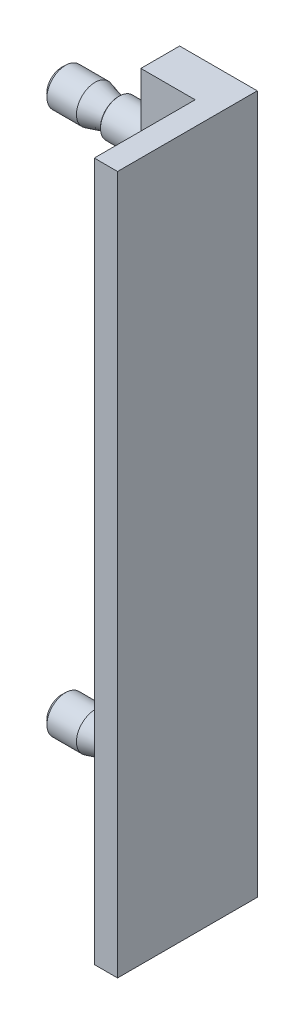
ISO-10303-21;
HEADER;
FILE_DESCRIPTION(('STEP AP214'),'2;1');
FILE_NAME('part.step','',(''),(''),'','','');
FILE_SCHEMA(('AUTOMOTIVE_DESIGN { 1 0 10303 214 1 1 1 1 }'));
ENDSEC;
DATA;
#1=APPLICATION_CONTEXT('core data for automotive mechanical design processes');
#2=APPLICATION_PROTOCOL_DEFINITION('international standard','automotive_design',2000,#1);
#3=PRODUCT_CONTEXT('',#1,'mechanical');
#4=PRODUCT('Part','Part','',(#3));
#5=PRODUCT_RELATED_PRODUCT_CATEGORY('part','',(#4));
#6=PRODUCT_DEFINITION_FORMATION('','',#4);
#7=PRODUCT_DEFINITION_CONTEXT('part definition',#1,'design');
#8=PRODUCT_DEFINITION('design','',#6,#7);
#9=PRODUCT_DEFINITION_SHAPE('','',#8);
#10=(LENGTH_UNIT() NAMED_UNIT(*) SI_UNIT(.MILLI.,.METRE.));
#11=(NAMED_UNIT(*) PLANE_ANGLE_UNIT() SI_UNIT($,.RADIAN.));
#12=(NAMED_UNIT(*) SI_UNIT($,.STERADIAN.) SOLID_ANGLE_UNIT());
#13=UNCERTAINTY_MEASURE_WITH_UNIT(LENGTH_MEASURE(1.E-05),#10,'distance_accuracy_value','');
#14=(GEOMETRIC_REPRESENTATION_CONTEXT(3) GLOBAL_UNCERTAINTY_ASSIGNED_CONTEXT((#13)) GLOBAL_UNIT_ASSIGNED_CONTEXT((#10,
#11,#12)) REPRESENTATION_CONTEXT('',''));
#15=CARTESIAN_POINT('',(0.,0.,0.));
#16=DIRECTION('',(0.,0.,1.));
#17=DIRECTION('',(1.,0.,0.));
#18=AXIS2_PLACEMENT_3D('',#15,#16,#17);
#19=CARTESIAN_POINT('',(-23.6849023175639,35.,1.90021068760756));
#20=DIRECTION('',(1.,0.,0.));
#21=DIRECTION('',(0.,1.,0.));
#22=AXIS2_PLACEMENT_3D('',#19,#20,#21);
#23=CONICAL_SURFACE('',#22,1.34162516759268,0.991977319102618);
#24=CARTESIAN_POINT('',(-23.6849023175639,35.,1.90021068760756));
#25=DIRECTION('',(1.,0.,0.));
#26=DIRECTION('',(0.,1.,0.));
#27=AXIS2_PLACEMENT_3D('',#24,#25,#26);
#28=CIRCLE('',#27,1.34162516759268);
#29=CARTESIAN_POINT('',(-23.6849023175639,36.3416251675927,1.90021068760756));
#30=VERTEX_POINT('',#29);
#31=EDGE_CURVE('E398',#30,#30,#28,.T.);
#32=ORIENTED_EDGE('',*,*,#31,.T.);
#33=EDGE_LOOP('',(#32));
#34=FACE_BOUND('',#33,.T.);
#35=CARTESIAN_POINT('',(-20.152868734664,28.5265609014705,0.));
#36=CARTESIAN_POINT('',(-20.255414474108,28.6901191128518,0.));
#37=CARTESIAN_POINT('',(-20.3577522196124,28.8538083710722,0.));
#38=CARTESIAN_POINT('',(-20.5618747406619,29.1815403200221,0.));
#39=CARTESIAN_POINT('',(-20.6636594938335,29.3455830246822,0.));
#40=CARTESIAN_POINT('',(-20.8667241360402,29.6744131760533,0.));
#41=CARTESIAN_POINT('',(-20.9680026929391,29.8392014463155,0.));
#42=CARTESIAN_POINT('',(-21.169643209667,30.1693317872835,0.));
#43=CARTESIAN_POINT('',(-21.2700051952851,30.3346738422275,0.));
#44=CARTESIAN_POINT('',(-21.4836938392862,30.6896316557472,0.));
#45=CARTESIAN_POINT('',(-21.5968365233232,30.879358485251,0.));
#46=CARTESIAN_POINT('',(-21.8208744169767,31.2601620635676,0.));
#47=CARTESIAN_POINT('',(-21.9317694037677,31.4512389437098,0.));
#48=CARTESIAN_POINT('',(-22.1500982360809,31.8351309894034,0.));
#49=CARTESIAN_POINT('',(-22.2575353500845,32.0279442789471,0.));
#50=CARTESIAN_POINT('',(-22.4146746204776,32.3193144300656,0.));
#51=CARTESIAN_POINT('',(-22.4663812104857,32.4167887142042,0.));
#52=CARTESIAN_POINT('',(-22.5680558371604,32.6126378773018,0.));
#53=CARTESIAN_POINT('',(-22.6180239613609,32.7110127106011,0.));
#54=CARTESIAN_POINT('',(-22.7059368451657,32.8891261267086,0.));
#55=CARTESIAN_POINT('',(-22.7442897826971,32.9686627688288,0.));
#56=CARTESIAN_POINT('',(-22.8191685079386,33.128597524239,0.));
#57=CARTESIAN_POINT('',(-22.8556942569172,33.2089956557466,0.));
#58=CARTESIAN_POINT('',(-22.926473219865,33.3709076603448,0.));
#59=CARTESIAN_POINT('',(-22.9607236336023,33.4524227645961,0.));
#60=CARTESIAN_POINT('',(-23.026261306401,33.6166444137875,0.));
#61=CARTESIAN_POINT('',(-23.0575486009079,33.6993509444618,0.));
#62=CARTESIAN_POINT('',(-23.1152492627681,33.8630449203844,0.));
#63=CARTESIAN_POINT('',(-23.1417996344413,33.9439835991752,0.));
#64=CARTESIAN_POINT('',(-23.1904686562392,34.1072073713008,0.));
#65=CARTESIAN_POINT('',(-23.2125869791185,34.1894925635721,0.));
#66=CARTESIAN_POINT('',(-23.251292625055,34.3551459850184,0.));
#67=CARTESIAN_POINT('',(-23.267894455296,34.4385107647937,0.));
#68=CARTESIAN_POINT('',(-23.2946105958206,34.6062533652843,0.));
#69=CARTESIAN_POINT('',(-23.3047282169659,34.6906306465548,0.));
#70=CARTESIAN_POINT('',(-23.3175020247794,34.8570999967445,0.));
#71=CARTESIAN_POINT('',(-23.320398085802,34.9391732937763,0.));
#72=CARTESIAN_POINT('',(-23.319200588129,35.1032861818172,0.));
#73=CARTESIAN_POINT('',(-23.3151054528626,35.1853257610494,0.));
#74=CARTESIAN_POINT('',(-23.300104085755,35.3502984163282,0.));
#75=CARTESIAN_POINT('',(-23.2890731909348,35.4332199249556,0.));
#76=CARTESIAN_POINT('',(-23.2608831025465,35.5979651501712,0.));
#77=CARTESIAN_POINT('',(-23.24372561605,35.6797891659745,0.));
#78=CARTESIAN_POINT('',(-23.1904982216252,35.8989115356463,0.));
#79=CARTESIAN_POINT('',(-23.1495900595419,36.0350261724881,0.));
#80=CARTESIAN_POINT('',(-23.0575490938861,36.3038052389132,0.));
#81=CARTESIAN_POINT('',(-23.006402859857,36.4364648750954,0.));
#82=CARTESIAN_POINT('',(-22.8969138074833,36.6997303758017,0.));
#83=CARTESIAN_POINT('',(-22.8385272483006,36.8303177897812,0.));
#84=CARTESIAN_POINT('',(-22.7170731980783,37.0891883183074,0.));
#85=CARTESIAN_POINT('',(-22.6540081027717,37.2174725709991,0.));
#86=CARTESIAN_POINT('',(-22.5284514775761,37.4647652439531,0.));
#87=CARTESIAN_POINT('',(-22.4661498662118,37.5838707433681,0.));
#88=CARTESIAN_POINT('',(-22.3394113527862,37.8209571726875,0.));
#89=CARTESIAN_POINT('',(-22.2749741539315,37.9389379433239,0.));
#90=CARTESIAN_POINT('',(-22.1454323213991,38.1723618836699,0.));
#91=CARTESIAN_POINT('',(-22.0803498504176,38.2878173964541,0.));
#92=CARTESIAN_POINT('',(-21.948998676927,38.5180120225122,0.));
#93=CARTESIAN_POINT('',(-21.8827302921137,38.6327513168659,0.));
#94=CARTESIAN_POINT('',(-21.8160291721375,38.7472339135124,0.));
#95=B_SPLINE_CURVE_WITH_KNOTS('',3,(#35,#36,#37,#38,#39,#40,#41,#42,#43,#44,#45,#46,#47,#48,#49,
#50,#51,#52,#53,#54,#55,#56,#57,#58,#59,#60,#61,#62,#63,#64,#65,#66,#67,#68,#69,#70,#71,#72,#73,
#74,#75,#76,#77,#78,#79,#80,#81,#82,#83,#84,#85,#86,#87,#88,#89,#90,#91,#92,#93,#94),
.UNSPECIFIED.,.F.,.F.,(4,2,2,2,2,2,2,2,2,2,2,2,2,2,2,2,2,2,2,2,2,2,2,2,2,2,2,2,2,4),(0.,
0.5791398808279,1.15830302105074,1.73857010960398,2.31882082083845,2.98151411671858,
3.64427279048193,4.30638541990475,4.63739156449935,4.96838101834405,5.23326542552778,
5.49815544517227,5.76336564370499,6.02857266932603,6.28401860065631,6.53948338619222,
6.79427093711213,7.04892828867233,7.29500689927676,7.54114100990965,7.79183079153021,
8.04245077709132,8.46817320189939,8.89445779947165,9.32345613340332,9.75223628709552,
10.1554558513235,10.5587316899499,10.956330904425,11.3538251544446),.UNSPECIFIED.);
#96=CARTESIAN_POINT('',(-23.3077026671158,34.7332646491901,0.));
#97=VERTEX_POINT('',#96);
#98=CARTESIAN_POINT('',(-23.3077026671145,35.2667353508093,0.));
#99=VERTEX_POINT('',#98);
#100=EDGE_CURVE('E325',#97,#99,#95,.T.);
#101=ORIENTED_EDGE('',*,*,#100,.F.);
#102=CARTESIAN_POINT('',(-23.3077026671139,35.,1.90021068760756));
#103=DIRECTION('',(1.,0.,0.));
#104=DIRECTION('',(0.,1.,0.));
#105=AXIS2_PLACEMENT_3D('',#102,#103,#104);
#106=CIRCLE('',#105,1.91884038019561);
#107=EDGE_CURVE('E496',#99,#97,#106,.T.);
#108=ORIENTED_EDGE('',*,*,#107,.F.);
#109=EDGE_LOOP('',(#101,#108));
#110=FACE_BOUND('',#109,.T.);
#111=ADVANCED_FACE('F14',(#34,#110),#23,.T.);
#112=CARTESIAN_POINT('',(-23.3077026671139,35.,1.90021068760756));
#113=DIRECTION('',(1.,0.,0.));
#114=DIRECTION('',(0.,1.,0.));
#115=AXIS2_PLACEMENT_3D('',#112,#113,#114);
#116=CONICAL_SURFACE('',#115,1.91884038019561,0.760039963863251);
#117=CARTESIAN_POINT('',(-20.8439244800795,31.1864695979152,0.));
#118=CARTESIAN_POINT('',(-20.9254014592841,31.2730101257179,0.));
#119=CARTESIAN_POINT('',(-21.0065992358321,31.3598158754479,0.));
#120=CARTESIAN_POINT('',(-21.1682882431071,31.5340976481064,0.));
#121=CARTESIAN_POINT('',(-21.2487794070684,31.6215737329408,0.));
#122=CARTESIAN_POINT('',(-21.4091963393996,31.7976541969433,0.));
#123=CARTESIAN_POINT('',(-21.4891187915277,31.886261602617,0.));
#124=CARTESIAN_POINT('',(-21.6478598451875,32.0644545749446,0.));
#125=CARTESIAN_POINT('',(-21.7266784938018,32.1540400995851,0.));
#126=CARTESIAN_POINT('',(-21.8871966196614,32.3393719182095,0.));
#127=CARTESIAN_POINT('',(-21.9688171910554,32.4351867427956,0.));
#128=CARTESIAN_POINT('',(-22.1299954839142,32.6285344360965,0.));
#129=CARTESIAN_POINT('',(-22.2095533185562,32.7260672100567,0.));
#130=CARTESIAN_POINT('',(-22.3657520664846,32.9232069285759,0.));
#131=CARTESIAN_POINT('',(-22.4423972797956,33.0228104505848,0.));
#132=CARTESIAN_POINT('',(-22.5917759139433,33.2248944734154,0.));
#133=CARTESIAN_POINT('',(-22.6645105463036,33.3273740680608,0.));
#134=CARTESIAN_POINT('',(-22.7835845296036,33.5052016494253,0.));
#135=CARTESIAN_POINT('',(-22.8313561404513,33.5795855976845,0.));
#136=CARTESIAN_POINT('',(-22.9231846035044,33.7306698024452,0.));
#137=CARTESIAN_POINT('',(-22.9672400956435,33.8073708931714,0.));
#138=CARTESIAN_POINT('',(-23.0500229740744,33.9629041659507,0.));
#139=CARTESIAN_POINT('',(-23.0887877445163,34.0417161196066,0.));
#140=CARTESIAN_POINT('',(-23.1596307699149,34.2022432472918,0.));
#141=CARTESIAN_POINT('',(-23.1917140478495,34.2839561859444,0.));
#142=CARTESIAN_POINT('',(-23.2542816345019,34.4723128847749,0.));
#143=CARTESIAN_POINT('',(-23.28215046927,34.5798850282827,0.));
#144=CARTESIAN_POINT('',(-23.3099544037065,34.7434003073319,0.));
#145=CARTESIAN_POINT('',(-23.316889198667,34.7981872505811,0.));
#146=CARTESIAN_POINT('',(-23.3257982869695,34.908175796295,0.));
#147=CARTESIAN_POINT('',(-23.3277727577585,34.9633773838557,0.));
#148=CARTESIAN_POINT('',(-23.3266392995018,35.0738599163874,0.));
#149=CARTESIAN_POINT('',(-23.3235189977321,35.1291407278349,0.));
#150=CARTESIAN_POINT('',(-23.3123501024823,35.2391974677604,0.));
#151=CARTESIAN_POINT('',(-23.3043012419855,35.2939733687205,0.));
#152=CARTESIAN_POINT('',(-23.2836509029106,35.4028484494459,0.));
#153=CARTESIAN_POINT('',(-23.2710335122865,35.4569445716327,0.));
#154=CARTESIAN_POINT('',(-23.2418034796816,35.5640343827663,0.));
#155=CARTESIAN_POINT('',(-23.2251904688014,35.6170279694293,0.));
#156=CARTESIAN_POINT('',(-23.1677524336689,35.7813574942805,0.));
#157=CARTESIAN_POINT('',(-23.1208628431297,35.8905765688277,0.));
#158=CARTESIAN_POINT('',(-23.0165930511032,36.1038986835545,0.));
#159=CARTESIAN_POINT('',(-22.9591940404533,36.2079921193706,0.));
#160=CARTESIAN_POINT('',(-22.8365193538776,36.4134254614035,0.));
#161=CARTESIAN_POINT('',(-22.7711418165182,36.5147038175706,0.));
#162=CARTESIAN_POINT('',(-22.6694234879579,36.6640273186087,0.));
#163=CARTESIAN_POINT('',(-22.6349227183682,36.7133509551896,0.));
#164=CARTESIAN_POINT('',(-22.564883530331,36.8112544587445,0.));
#165=CARTESIAN_POINT('',(-22.5293451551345,36.8598343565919,0.));
#166=CARTESIAN_POINT('',(-22.41058610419,37.0191562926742,0.));
#167=CARTESIAN_POINT('',(-22.3255062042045,37.1285116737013,0.));
#168=CARTESIAN_POINT('',(-22.1521766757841,37.344689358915,0.));
#169=CARTESIAN_POINT('',(-22.063926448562,37.4515111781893,0.));
#170=CARTESIAN_POINT('',(-21.885094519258,37.6632835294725,0.));
#171=CARTESIAN_POINT('',(-21.7945115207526,37.7682329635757,0.));
#172=CARTESIAN_POINT('',(-21.6116430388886,37.9766406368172,0.));
#173=CARTESIAN_POINT('',(-21.519357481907,38.0800988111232,0.));
#174=CARTESIAN_POINT('',(-21.2400903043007,38.3892775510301,0.));
#175=CARTESIAN_POINT('',(-21.0511740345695,38.5932483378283,0.));
#176=CARTESIAN_POINT('',(-20.6702550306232,38.9981339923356,0.));
#177=CARTESIAN_POINT('',(-20.4782533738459,39.1990498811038,0.));
#178=CARTESIAN_POINT('',(-20.1157611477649,39.5743776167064,0.));
#179=CARTESIAN_POINT('',(-19.9455133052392,39.7490242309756,0.));
#180=CARTESIAN_POINT('',(-19.6038147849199,40.0971704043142,0.));
#181=CARTESIAN_POINT('',(-19.4323639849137,40.2706698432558,0.));
#182=CARTESIAN_POINT('',(-19.089430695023,40.6159275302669,0.));
#183=CARTESIAN_POINT('',(-18.9179525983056,40.7876901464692,0.));
#184=CARTESIAN_POINT('',(-18.5743300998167,41.1305054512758,0.));
#185=CARTESIAN_POINT('',(-18.4021857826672,41.3015582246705,0.));
#186=CARTESIAN_POINT('',(-18.2297927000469,41.472358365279,0.));
#187=B_SPLINE_CURVE_WITH_KNOTS('',3,(#117,#118,#119,#120,#121,#122,#123,#124,#125,#126,#127,
#128,#129,#130,#131,#132,#133,#134,#135,#136,#137,#138,#139,#140,#141,#142,#143,#144,#145,#146,
#147,#148,#149,#150,#151,#152,#153,#154,#155,#156,#157,#158,#159,#160,#161,#162,#163,#164,#165,
#166,#167,#168,#169,#170,#171,#172,#173,#174,#175,#176,#177,#178,#179,#180,#181,#182,#183,#184,
#185,#186),.UNSPECIFIED.,.F.,.F.,(4,2,2,2,2,2,2,2,2,2,2,2,2,2,2,2,2,2,2,2,2,2,2,2,2,2,2,2,2,2,2,
2,2,2,4),(0.,0.356582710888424,0.713198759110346,1.07117159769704,1.42912912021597,
1.80670766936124,2.18426545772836,2.56124228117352,2.93810163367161,3.20322948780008,
3.46845395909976,3.73169484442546,3.99473711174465,4.32661381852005,4.49209268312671,
4.65756562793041,4.82344102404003,4.98932540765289,5.15579320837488,5.32227638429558,
5.67789990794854,6.03416624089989,6.39558226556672,6.57615103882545,6.75671229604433,
7.1722770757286,7.58792076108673,8.00380064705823,8.41969855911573,9.25368457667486,
10.0873854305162,10.8190687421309,11.5508274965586,12.2789491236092,13.006981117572),.UNSPECIFIED.);
#188=CARTESIAN_POINT('',(-22.8013790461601,33.5337970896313,0.));
#189=VERTEX_POINT('',#188);
#190=EDGE_CURVE('E324',#189,#97,#187,.T.);
#191=ORIENTED_EDGE('',*,*,#190,.F.);
#192=CARTESIAN_POINT('',(-22.8013790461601,35.,1.90021068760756));
#193=DIRECTION('',(1.,0.,0.));
#194=DIRECTION('',(0.,1.,0.));
#195=AXIS2_PLACEMENT_3D('',#192,#193,#194);
#196=CIRCLE('',#195,2.4001149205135);
#197=CARTESIAN_POINT('',(-22.8013790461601,36.4662029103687,0.));
#198=VERTEX_POINT('',#197);
#199=EDGE_CURVE('E493',#198,#189,#196,.T.);
#200=ORIENTED_EDGE('',*,*,#199,.F.);
#201=EDGE_CURVE('E317',#99,#198,#187,.T.);
#202=ORIENTED_EDGE('',*,*,#201,.F.);
#203=ORIENTED_EDGE('',*,*,#107,.T.);
#204=EDGE_LOOP('',(#191,#200,#202,#203));
#205=FACE_BOUND('',#204,.T.);
#206=ADVANCED_FACE('F332',(#205),#116,.T.);
#207=CARTESIAN_POINT('',(-10.0009576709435,35.,1.90021068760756));
#208=DIRECTION('',(1.,0.,0.));
#209=DIRECTION('',(0.,1.,0.));
#210=AXIS2_PLACEMENT_3D('',#207,#208,#209);
#211=CYLINDRICAL_SURFACE('',#210,2.4001149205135);
#212=DIRECTION('',(1.,0.,0.));
#213=VECTOR('',#212,1.);
#214=CARTESIAN_POINT('',(-10.0009576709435,36.4662029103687,0.));
#215=LINE('',#214,#213);
#216=CARTESIAN_POINT('',(-19.0015322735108,36.4662029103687,0.));
#217=VERTEX_POINT('',#216);
#218=EDGE_CURVE('E35',#198,#217,#215,.T.);
#219=ORIENTED_EDGE('',*,*,#218,.F.);
#220=ORIENTED_EDGE('',*,*,#199,.T.);
#221=DIRECTION('',(1.,0.,0.));
#222=VECTOR('',#221,1.);
#223=CARTESIAN_POINT('',(-10.0009576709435,33.5337970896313,0.));
#224=LINE('',#223,#222);
#225=CARTESIAN_POINT('',(-19.0015322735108,33.5337970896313,0.));
#226=VERTEX_POINT('',#225);
#227=EDGE_CURVE('E449',#226,#189,#224,.F.);
#228=ORIENTED_EDGE('',*,*,#227,.F.);
#229=CARTESIAN_POINT('',(-19.0015322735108,35.,1.90021068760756));
#230=DIRECTION('',(1.,0.,0.));
#231=DIRECTION('',(0.,1.,0.));
#232=AXIS2_PLACEMENT_3D('',#229,#230,#231);
#233=CIRCLE('',#232,2.4001149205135);
#234=EDGE_CURVE('E490',#217,#226,#233,.T.);
#235=ORIENTED_EDGE('',*,*,#234,.F.);
#236=EDGE_LOOP('',(#219,#220,#228,#235));
#237=FACE_BOUND('',#236,.T.);
#238=ADVANCED_FACE('F336',(#237),#211,.T.);
#239=CARTESIAN_POINT('',(-19.0015322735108,35.,1.90021068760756));
#240=DIRECTION('',(-1.,0.,0.));
#241=DIRECTION('',(0.,-1.,0.));
#242=AXIS2_PLACEMENT_3D('',#239,#240,#241);
#243=CONICAL_SURFACE('',#242,2.4001149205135,0.261760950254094);
#244=CARTESIAN_POINT('',(-16.3784715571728,35.,1.90021068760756));
#245=DIRECTION('',(1.,0.,0.));
#246=DIRECTION('',(0.,1.,0.));
#247=AXIS2_PLACEMENT_3D('',#244,#245,#246);
#248=CIRCLE('',#247,1.69737598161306);
#249=CARTESIAN_POINT('',(-16.3784715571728,36.6973759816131,1.90021068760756));
#250=VERTEX_POINT('',#249);
#251=EDGE_CURVE('E487',#250,#250,#248,.T.);
#252=ORIENTED_EDGE('',*,*,#251,.F.);
#253=EDGE_LOOP('',(#252));
#254=FACE_BOUND('',#253,.T.);
#255=CARTESIAN_POINT('',(-21.9498762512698,32.4377161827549,0.));
#256=CARTESIAN_POINT('',(-21.8062573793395,32.48562775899,0.));
#257=CARTESIAN_POINT('',(-21.6627751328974,32.5339535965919,0.));
#258=CARTESIAN_POINT('',(-21.3761477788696,32.6316250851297,0.));
#259=CARTESIAN_POINT('',(-21.233002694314,32.680970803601,0.));
#260=CARTESIAN_POINT('',(-20.9467982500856,32.7809838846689,0.));
#261=CARTESIAN_POINT('',(-20.8037398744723,32.8316540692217,0.));
#262=CARTESIAN_POINT('',(-20.518156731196,32.9344652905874,0.));
#263=CARTESIAN_POINT('',(-20.3756319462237,32.9866062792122,0.));
#264=CARTESIAN_POINT('',(-20.0913111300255,33.0926896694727,0.));
#265=CARTESIAN_POINT('',(-19.9495148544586,33.1466314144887,0.));
#266=CARTESIAN_POINT('',(-19.6668194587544,33.2568144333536,0.));
#267=CARTESIAN_POINT('',(-19.5259203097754,33.3130556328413,0.));
#268=CARTESIAN_POINT('',(-19.2454807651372,33.4284834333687,0.));
#269=CARTESIAN_POINT('',(-19.1059392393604,33.4876672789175,0.));
#270=CARTESIAN_POINT('',(-18.8286407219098,33.6100585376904,0.));
#271=CARTESIAN_POINT('',(-18.6908833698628,33.6732651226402,0.));
#272=CARTESIAN_POINT('',(-18.502869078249,33.764387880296,0.));
#273=CARTESIAN_POINT('',(-18.4514168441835,33.7898352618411,0.));
#274=CARTESIAN_POINT('',(-18.3490065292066,33.8417108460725,0.));
#275=CARTESIAN_POINT('',(-18.2980484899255,33.8681391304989,0.));
#276=CARTESIAN_POINT('',(-18.1457640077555,33.9492876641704,0.));
#277=CARTESIAN_POINT('',(-18.0453268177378,34.005728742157,0.));
#278=CARTESIAN_POINT('',(-17.8979844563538,34.0951935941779,0.));
#279=CARTESIAN_POINT('',(-17.8495623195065,34.125717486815,0.));
#280=CARTESIAN_POINT('',(-17.7540768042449,34.1888121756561,0.));
#281=CARTESIAN_POINT('',(-17.7070130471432,34.2213823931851,0.));
#282=CARTESIAN_POINT('',(-17.6149422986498,34.2889782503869,0.));
#283=CARTESIAN_POINT('',(-17.569928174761,34.323994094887,0.));
#284=CARTESIAN_POINT('',(-17.4826710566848,34.3972933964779,0.));
#285=CARTESIAN_POINT('',(-17.4404248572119,34.4355729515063,0.));
#286=CARTESIAN_POINT('',(-17.3716198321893,34.5049212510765,0.));
#287=CARTESIAN_POINT('',(-17.3440170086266,34.5349437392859,0.));
#288=CARTESIAN_POINT('',(-17.2918987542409,34.5976912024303,0.));
#289=CARTESIAN_POINT('',(-17.2673883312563,34.630420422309,0.));
#290=CARTESIAN_POINT('',(-17.2226371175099,34.699407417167,0.));
#291=CARTESIAN_POINT('',(-17.2024603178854,34.7357078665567,0.));
#292=CARTESIAN_POINT('',(-17.1690802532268,34.8113664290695,0.));
#293=CARTESIAN_POINT('',(-17.1558486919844,34.8507113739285,0.));
#294=CARTESIAN_POINT('',(-17.1410774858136,34.9198153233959,0.));
#295=CARTESIAN_POINT('',(-17.137272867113,34.949087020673,0.));
#296=CARTESIAN_POINT('',(-17.1347922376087,35.0078574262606,0.));
#297=CARTESIAN_POINT('',(-17.1361158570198,35.03735611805,0.));
#298=CARTESIAN_POINT('',(-17.1437164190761,35.0955935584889,0.));
#299=CARTESIAN_POINT('',(-17.1499779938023,35.1243343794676,0.));
#300=CARTESIAN_POINT('',(-17.1667447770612,35.1805268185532,0.));
#301=CARTESIAN_POINT('',(-17.1772522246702,35.2079777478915,0.));
#302=CARTESIAN_POINT('',(-17.209496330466,35.2784775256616,0.));
#303=CARTESIAN_POINT('',(-17.2341080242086,35.3201972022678,0.));
#304=CARTESIAN_POINT('',(-17.2892193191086,35.3995735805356,0.));
#305=CARTESIAN_POINT('',(-17.3197421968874,35.4372132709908,0.));
#306=CARTESIAN_POINT('',(-17.3964765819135,35.5223080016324,0.));
#307=CARTESIAN_POINT('',(-17.4443232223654,35.5682652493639,0.));
#308=CARTESIAN_POINT('',(-17.5441500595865,35.6555100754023,0.));
#309=CARTESIAN_POINT('',(-17.596139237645,35.6967870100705,0.));
#310=CARTESIAN_POINT('',(-17.7033755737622,35.7762983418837,0.));
#311=CARTESIAN_POINT('',(-17.7586552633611,35.8144884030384,0.));
#312=CARTESIAN_POINT('',(-17.870938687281,35.8880613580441,0.));
#313=CARTESIAN_POINT('',(-17.927940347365,35.9234474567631,0.));
#314=CARTESIAN_POINT('',(-18.0530263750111,35.9979044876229,0.));
#315=CARTESIAN_POINT('',(-18.1213461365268,36.0365778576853,0.));
#316=CARTESIAN_POINT('',(-18.259233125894,36.1116425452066,0.));
#317=CARTESIAN_POINT('',(-18.3288005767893,36.1480334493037,0.));
#318=CARTESIAN_POINT('',(-18.5389578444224,36.254548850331,0.));
#319=CARTESIAN_POINT('',(-18.6809164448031,36.3219666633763,0.));
#320=CARTESIAN_POINT('',(-18.9675191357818,36.4521837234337,0.));
#321=CARTESIAN_POINT('',(-19.1121711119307,36.514965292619,0.));
#322=CARTESIAN_POINT('',(-19.4028969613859,36.6369726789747,0.));
#323=CARTESIAN_POINT('',(-19.5489702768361,36.6961998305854,0.));
#324=CARTESIAN_POINT('',(-19.8250286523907,36.8052321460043,0.));
#325=CARTESIAN_POINT('',(-19.9548990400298,36.8553295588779,0.));
#326=CARTESIAN_POINT('',(-20.2152820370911,36.953869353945,0.));
#327=CARTESIAN_POINT('',(-20.345794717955,37.0023115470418,0.));
#328=CARTESIAN_POINT('',(-20.606378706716,37.097502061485,0.));
#329=CARTESIAN_POINT('',(-20.7364465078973,37.1442600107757,0.));
#330=CARTESIAN_POINT('',(-20.9969575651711,37.236648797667,0.));
#331=CARTESIAN_POINT('',(-21.1274007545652,37.2822798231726,0.));
#332=CARTESIAN_POINT('',(-21.2579983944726,37.3274583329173,0.));
#333=B_SPLINE_CURVE_WITH_KNOTS('',3,(#255,#256,#257,#258,#259,#260,#261,#262,#263,#264,#265,
#266,#267,#268,#269,#270,#271,#272,#273,#274,#275,#276,#277,#278,#279,#280,#281,#282,#283,#284,
#285,#286,#287,#288,#289,#290,#291,#292,#293,#294,#295,#296,#297,#298,#299,#300,#301,#302,#303,
#304,#305,#306,#307,#308,#309,#310,#311,#312,#313,#314,#315,#316,#317,#318,#319,#320,#321,#322,
#323,#324,#325,#326,#327,#328,#329,#330,#331,#332),.UNSPECIFIED.,.F.,.F.,(4,2,2,2,2,2,2,2,2,2,2,
2,2,2,2,2,2,2,2,2,2,2,2,2,2,2,2,2,2,2,2,2,2,2,2,2,2,2,4),(0.,0.454201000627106,
0.908432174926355,1.36372604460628,1.81900501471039,2.27411974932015,2.72921977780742,
3.1839013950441,3.63848969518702,3.81068310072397,3.98289088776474,4.32830172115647,
4.49998452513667,4.67161899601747,4.84260162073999,5.01338261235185,5.13558373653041,
5.25798028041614,5.38207585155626,5.50566183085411,5.59380081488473,5.68193344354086,
5.76979286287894,5.85769867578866,6.00216838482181,6.1472189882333,6.34574962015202,
6.54472304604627,6.74617654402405,6.94739636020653,7.18285547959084,7.41835711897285,
7.88965781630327,8.36267155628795,8.83550658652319,9.25308792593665,9.67071681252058,
10.0853624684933,10.4999385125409),.UNSPECIFIED.);
#334=EDGE_CURVE('E309',#217,#226,#333,.F.);
#335=ORIENTED_EDGE('',*,*,#334,.F.);
#336=ORIENTED_EDGE('',*,*,#234,.T.);
#337=EDGE_LOOP('',(#335,#336));
#338=FACE_BOUND('',#337,.T.);
#339=ADVANCED_FACE('F514',(#254,#338),#243,.T.);
#340=CARTESIAN_POINT('',(-16.0245522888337,35.,1.90021068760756));
#341=DIRECTION('',(1.,0.,0.));
#342=DIRECTION('',(0.,1.,0.));
#343=AXIS2_PLACEMENT_3D('',#340,#341,#342);
#344=CONICAL_SURFACE('',#343,1.87029544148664,1.37127084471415);
#345=CARTESIAN_POINT('',(-16.0245522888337,35.,1.90021068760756));
#346=DIRECTION('',(1.,0.,0.));
#347=DIRECTION('',(0.,1.,0.));
#348=AXIS2_PLACEMENT_3D('',#345,#346,#347);
#349=CIRCLE('',#348,1.87029544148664);
#350=CARTESIAN_POINT('',(-16.0245522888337,36.8702954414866,1.90021068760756));
#351=VERTEX_POINT('',#350);
#352=EDGE_CURVE('E475',#351,#351,#349,.T.);
#353=ORIENTED_EDGE('',*,*,#352,.T.);
#354=EDGE_LOOP('',(#353));
#355=FACE_BOUND('',#354,.T.);
#356=CARTESIAN_POINT('',(-15.7201400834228,32.2099480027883,0.));
#357=CARTESIAN_POINT('',(-15.7343598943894,32.2950421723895,0.));
#358=CARTESIAN_POINT('',(-15.7483842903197,32.3801690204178,0.));
#359=CARTESIAN_POINT('',(-15.7759446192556,32.5505041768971,0.));
#360=CARTESIAN_POINT('',(-15.7894805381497,32.6357124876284,0.));
#361=CARTESIAN_POINT('',(-15.8292313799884,32.8916275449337,0.));
#362=CARTESIAN_POINT('',(-15.8545638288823,33.0624735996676,0.));
#363=CARTESIAN_POINT('',(-15.9015215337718,33.4035386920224,0.));
#364=CARTESIAN_POINT('',(-15.9231700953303,33.5737544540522,0.));
#365=CARTESIAN_POINT('',(-15.9611839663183,33.914731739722,0.));
#366=CARTESIAN_POINT('',(-15.9775511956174,34.0854930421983,0.));
#367=CARTESIAN_POINT('',(-16.0027913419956,34.4284506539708,0.));
#368=CARTESIAN_POINT('',(-16.0116272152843,34.6006498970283,0.));
#369=CARTESIAN_POINT('',(-16.0178415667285,34.8591285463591,0.));
#370=CARTESIAN_POINT('',(-16.0187394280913,34.9453294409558,0.));
#371=CARTESIAN_POINT('',(-16.0181607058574,35.1177216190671,0.));
#372=CARTESIAN_POINT('',(-16.0166841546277,35.2039129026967,0.));
#373=CARTESIAN_POINT('',(-16.0087557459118,35.4634004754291,0.));
#374=CARTESIAN_POINT('',(-15.9987815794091,35.6365967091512,0.));
#375=CARTESIAN_POINT('',(-15.9782446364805,35.8959188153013,0.));
#376=CARTESIAN_POINT('',(-15.9704687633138,35.9822885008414,0.));
#377=CARTESIAN_POINT('',(-15.953358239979,36.1548576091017,0.));
#378=CARTESIAN_POINT('',(-15.944023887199,36.2410570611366,0.));
#379=CARTESIAN_POINT('',(-15.9340587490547,36.3271840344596,0.));
#380=B_SPLINE_CURVE_WITH_KNOTS('',3,(#356,#357,#358,#359,#360,#361,#362,#363,#364,#365,#366,
#367,#368,#369,#370,#371,#372,#373,#374,#375,#376,#377,#378,#379),.UNSPECIFIED.,.F.,.F.,(4,2,2,
2,2,2,2,2,2,2,2,4),(0.,0.258821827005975,0.51765112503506,1.03576859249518,1.55047545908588,
2.06499500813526,2.58203090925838,2.84061707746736,3.09919972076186,3.61940295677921,
3.87955103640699,4.13964953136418),.UNSPECIFIED.);
#381=CARTESIAN_POINT('',(-16.0009576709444,34.4192490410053,0.));
#382=VERTEX_POINT('',#381);
#383=CARTESIAN_POINT('',(-16.0009576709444,35.5807509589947,0.));
#384=VERTEX_POINT('',#383);
#385=EDGE_CURVE('E287',#382,#384,#380,.T.);
#386=ORIENTED_EDGE('',*,*,#385,.F.);
#387=CARTESIAN_POINT('',(-16.0009576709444,35.,1.90021068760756));
#388=DIRECTION('',(1.,0.,0.));
#389=DIRECTION('',(0.,1.,0.));
#390=AXIS2_PLACEMENT_3D('',#387,#388,#389);
#391=CIRCLE('',#390,1.98697567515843);
#392=EDGE_CURVE('E468',#384,#382,#391,.T.);
#393=ORIENTED_EDGE('',*,*,#392,.F.);
#394=EDGE_LOOP('',(#386,#393));
#395=FACE_BOUND('',#394,.T.);
#396=ADVANCED_FACE('F516',(#355,#395),#344,.T.);
#397=CARTESIAN_POINT('',(-16.0009576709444,35.,3.88718636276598));
#398=DIRECTION('',(1.,0.,0.));
#399=DIRECTION('',(0.,1.,0.));
#400=AXIS2_PLACEMENT_3D('',#397,#398,#399);
#401=PLANE('',#400);
#402=DIRECTION('',(0.,1.,0.));
#403=VECTOR('',#402,1.);
#404=CARTESIAN_POINT('',(-16.0009576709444,35.,0.));
#405=LINE('',#404,#403);
#406=CARTESIAN_POINT('',(-16.0009576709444,33.7039228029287,0.));
#407=VERTEX_POINT('',#406);
#408=EDGE_CURVE('E451',#407,#382,#405,.T.);
#409=ORIENTED_EDGE('',*,*,#408,.F.);
#410=CARTESIAN_POINT('',(-16.0009576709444,35.,1.90021068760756));
#411=DIRECTION('',(1.,0.,0.));
#412=DIRECTION('',(0.,1.,0.));
#413=AXIS2_PLACEMENT_3D('',#410,#411,#412);
#414=CIRCLE('',#413,2.30013407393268);
#415=CARTESIAN_POINT('',(-16.0009576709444,36.2960771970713,0.));
#416=VERTEX_POINT('',#415);
#417=EDGE_CURVE('E466',#416,#407,#414,.T.);
#418=ORIENTED_EDGE('',*,*,#417,.F.);
#419=EDGE_CURVE('E453',#384,#416,#405,.T.);
#420=ORIENTED_EDGE('',*,*,#419,.F.);
#421=ORIENTED_EDGE('',*,*,#392,.T.);
#422=EDGE_LOOP('',(#409,#418,#420,#421));
#423=FACE_BOUND('',#422,.T.);
#424=ADVANCED_FACE('F523',(#423),#401,.F.);
#425=CARTESIAN_POINT('',(-16.0009576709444,35.,1.90021068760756));
#426=DIRECTION('',(1.,0.,0.));
#427=DIRECTION('',(0.,1.,0.));
#428=AXIS2_PLACEMENT_3D('',#425,#426,#427);
#429=CONICAL_SURFACE('',#428,2.30013407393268,0.785398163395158);
#430=CARTESIAN_POINT('',(-13.8849515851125,31.0135864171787,0.));
#431=CARTESIAN_POINT('',(-13.9688770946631,31.106572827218,0.));
#432=CARTESIAN_POINT('',(-14.052517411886,31.1998189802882,0.));
#433=CARTESIAN_POINT('',(-14.2190693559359,31.3869739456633,0.));
#434=CARTESIAN_POINT('',(-14.3019809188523,31.4808828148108,0.));
#435=CARTESIAN_POINT('',(-14.4671066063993,31.6697238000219,0.));
#436=CARTESIAN_POINT('',(-14.5493184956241,31.764657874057,0.));
#437=CARTESIAN_POINT('',(-14.712594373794,31.9555037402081,0.));
#438=CARTESIAN_POINT('',(-14.7936584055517,32.0514154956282,0.));
#439=CARTESIAN_POINT('',(-14.9528778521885,32.2427368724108,0.));
#440=CARTESIAN_POINT('',(-15.031059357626,32.3381247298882,0.));
#441=CARTESIAN_POINT('',(-15.1855668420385,32.5303901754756,0.));
#442=CARTESIAN_POINT('',(-15.2618929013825,32.6272676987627,0.));
#443=CARTESIAN_POINT('',(-15.41202266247,32.8228797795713,0.));
#444=CARTESIAN_POINT('',(-15.485827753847,32.9216132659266,0.));
#445=CARTESIAN_POINT('',(-15.6300199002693,33.121534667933,0.));
#446=CARTESIAN_POINT('',(-15.7004076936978,33.2227220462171,0.));
#447=CARTESIAN_POINT('',(-15.8228419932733,33.4079152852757,0.));
#448=CARTESIAN_POINT('',(-15.875755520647,33.4913439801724,0.));
#449=CARTESIAN_POINT('',(-15.9772989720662,33.660670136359,0.));
#450=CARTESIAN_POINT('',(-16.0259333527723,33.746564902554,0.));
#451=CARTESIAN_POINT('',(-16.1177163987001,33.9220576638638,0.));
#452=CARTESIAN_POINT('',(-16.1608251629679,34.0116770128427,0.));
#453=CARTESIAN_POINT('',(-16.2193958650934,34.1489010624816,0.));
#454=CARTESIAN_POINT('',(-16.2379314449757,34.1951928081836,0.));
#455=CARTESIAN_POINT('',(-16.2725833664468,34.2887102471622,0.));
#456=CARTESIAN_POINT('',(-16.2886978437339,34.3359366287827,0.));
#457=CARTESIAN_POINT('',(-16.3034118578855,34.383620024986,0.));
#458=B_SPLINE_CURVE_WITH_KNOTS('',3,(#430,#431,#432,#433,#434,#435,#436,#437,#438,#439,#440,
#441,#442,#443,#444,#445,#446,#447,#448,#449,#450,#451,#452,#453,#454,#455,#456,#457),
.UNSPECIFIED.,.F.,.F.,(4,2,2,2,2,2,2,2,2,2,2,2,2,4),(0.,0.375780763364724,0.751594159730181,
1.1283381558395,1.50506806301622,1.87505180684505,2.24501949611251,2.61477984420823,
2.98445993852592,3.28074749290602,3.57672272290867,3.87472739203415,4.02426084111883,
4.17390885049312),.UNSPECIFIED.);
#459=CARTESIAN_POINT('',(-15.9009768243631,33.5337970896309,0.));
#460=VERTEX_POINT('',#459);
#461=EDGE_CURVE('E295',#460,#407,#458,.T.);
#462=ORIENTED_EDGE('',*,*,#461,.F.);
#463=CARTESIAN_POINT('',(-15.9009768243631,35.,1.90021068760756));
#464=DIRECTION('',(1.,0.,0.));
#465=DIRECTION('',(0.,1.,0.));
#466=AXIS2_PLACEMENT_3D('',#463,#464,#465);
#467=CIRCLE('',#466,2.4001149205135);
#468=CARTESIAN_POINT('',(-15.9009768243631,36.4662029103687,0.));
#469=VERTEX_POINT('',#468);
#470=EDGE_CURVE('E464',#469,#460,#467,.T.);
#471=ORIENTED_EDGE('',*,*,#470,.F.);
#472=CARTESIAN_POINT('',(-16.3034118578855,35.616379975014,0.));
#473=CARTESIAN_POINT('',(-16.2886978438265,35.6640633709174,0.));
#474=CARTESIAN_POINT('',(-16.2725833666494,35.7112897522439,0.));
#475=CARTESIAN_POINT('',(-16.2379314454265,35.8048071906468,0.));
#476=CARTESIAN_POINT('',(-16.2193958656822,35.8510989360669,0.));
#477=CARTESIAN_POINT('',(-16.1608251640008,35.9883229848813,0.));
#478=CARTESIAN_POINT('',(-16.1177164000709,36.0779423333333,0.));
#479=CARTESIAN_POINT('',(-16.0259333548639,36.2534350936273,0.));
#480=CARTESIAN_POINT('',(-15.9772989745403,36.3393298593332,0.));
#481=CARTESIAN_POINT('',(-15.8757555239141,36.5086560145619,0.));
#482=CARTESIAN_POINT('',(-15.822841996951,36.5920847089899,0.));
#483=CARTESIAN_POINT('',(-15.7004076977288,36.7772779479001,0.));
#484=CARTESIAN_POINT('',(-15.6300199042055,36.8784653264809,0.));
#485=CARTESIAN_POINT('',(-15.485827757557,37.0783867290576,0.));
#486=CARTESIAN_POINT('',(-15.4120226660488,37.1771202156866,0.));
#487=CARTESIAN_POINT('',(-15.2618929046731,37.3727322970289,0.));
#488=CARTESIAN_POINT('',(-15.1855668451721,37.469609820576,0.));
#489=CARTESIAN_POINT('',(-15.03105936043,37.6618752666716,0.));
#490=CARTESIAN_POINT('',(-14.9528778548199,37.7572631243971,0.));
#491=CARTESIAN_POINT('',(-14.7936584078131,37.9485845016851,0.));
#492=CARTESIAN_POINT('',(-14.7125943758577,38.044496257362,0.));
#493=CARTESIAN_POINT('',(-14.5493184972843,38.2353421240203,0.));
#494=CARTESIAN_POINT('',(-14.4671066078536,38.3302761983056,0.));
#495=CARTESIAN_POINT('',(-14.3019809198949,38.5191171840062,0.));
#496=CARTESIAN_POINT('',(-14.2190693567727,38.6130260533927,0.));
#497=CARTESIAN_POINT('',(-14.0525174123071,38.8001810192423,0.));
#498=CARTESIAN_POINT('',(-13.9688770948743,38.8934271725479,0.));
#499=CARTESIAN_POINT('',(-13.8849515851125,38.9864135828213,0.));
#500=B_SPLINE_CURVE_WITH_KNOTS('',3,(#472,#473,#474,#475,#476,#477,#478,#479,#480,#481,#482,
#483,#484,#485,#486,#487,#488,#489,#490,#491,#492,#493,#494,#495,#496,#497,#498,#499),
.UNSPECIFIED.,.F.,.F.,(4,2,2,2,2,2,2,2,2,2,2,2,2,4),(0.,0.149648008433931,0.29918145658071,
0.597186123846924,0.893161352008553,1.18944890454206,1.55912899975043,1.92888934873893,
2.29885703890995,2.66884078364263,3.04557069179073,3.42231468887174,3.79812808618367,
4.17390885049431),.UNSPECIFIED.);
#501=EDGE_CURVE('E278',#416,#469,#500,.T.);
#502=ORIENTED_EDGE('',*,*,#501,.F.);
#503=ORIENTED_EDGE('',*,*,#417,.T.);
#504=EDGE_LOOP('',(#462,#471,#502,#503));
#505=FACE_BOUND('',#504,.T.);
#506=ADVANCED_FACE('F465',(#505),#429,.T.);
#507=CARTESIAN_POINT('',(-10.0009576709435,35.,1.90021068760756));
#508=DIRECTION('',(1.,0.,0.));
#509=DIRECTION('',(0.,1.,0.));
#510=AXIS2_PLACEMENT_3D('',#507,#508,#509);
#511=CYLINDRICAL_SURFACE('',#510,2.4001149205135);
#512=DIRECTION('',(1.,0.,0.));
#513=VECTOR('',#512,1.);
#514=CARTESIAN_POINT('',(-10.0009576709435,36.4662029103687,0.));
#515=LINE('',#514,#513);
#516=CARTESIAN_POINT('',(-10.1009385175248,36.4662029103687,0.));
#517=VERTEX_POINT('',#516);
#518=EDGE_CURVE('E43',#469,#517,#515,.T.);
#519=ORIENTED_EDGE('',*,*,#518,.F.);
#520=ORIENTED_EDGE('',*,*,#470,.T.);
#521=DIRECTION('',(1.,0.,0.));
#522=VECTOR('',#521,1.);
#523=CARTESIAN_POINT('',(-10.0009576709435,33.5337970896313,0.));
#524=LINE('',#523,#522);
#525=CARTESIAN_POINT('',(-10.1009385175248,33.5337970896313,0.));
#526=VERTEX_POINT('',#525);
#527=EDGE_CURVE('E448',#526,#460,#524,.F.);
#528=ORIENTED_EDGE('',*,*,#527,.F.);
#529=CARTESIAN_POINT('',(-10.1009385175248,35.,1.90021068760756));
#530=DIRECTION('',(1.,0.,0.));
#531=DIRECTION('',(0.,1.,0.));
#532=AXIS2_PLACEMENT_3D('',#529,#530,#531);
#533=CIRCLE('',#532,2.4001149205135);
#534=EDGE_CURVE('E446',#517,#526,#533,.T.);
#535=ORIENTED_EDGE('',*,*,#534,.F.);
#536=EDGE_LOOP('',(#519,#520,#528,#535));
#537=FACE_BOUND('',#536,.T.);
#538=ADVANCED_FACE('F463',(#537),#511,.T.);
#539=CARTESIAN_POINT('',(-10.1009385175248,35.,1.90021068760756));
#540=DIRECTION('',(-1.,0.,0.));
#541=DIRECTION('',(0.,-1.,0.));
#542=AXIS2_PLACEMENT_3D('',#539,#540,#541);
#543=CONICAL_SURFACE('',#542,2.4001149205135,0.785398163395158);
#544=CARTESIAN_POINT('',(-9.69850348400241,34.3836200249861,0.));
#545=CARTESIAN_POINT('',(-9.7132174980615,34.3359366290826,0.));
#546=CARTESIAN_POINT('',(-9.72933197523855,34.2887102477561,0.));
#547=CARTESIAN_POINT('',(-9.76398389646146,34.1951928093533,0.));
#548=CARTESIAN_POINT('',(-9.78251947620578,34.1489010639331,0.));
#549=CARTESIAN_POINT('',(-9.84109017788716,34.0116770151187,0.));
#550=CARTESIAN_POINT('',(-9.88419894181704,33.9220576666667,0.));
#551=CARTESIAN_POINT('',(-9.97598198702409,33.7465649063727,0.));
#552=CARTESIAN_POINT('',(-10.0246163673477,33.6606701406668,0.));
#553=CARTESIAN_POINT('',(-10.1261598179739,33.4913439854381,0.));
#554=CARTESIAN_POINT('',(-10.179073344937,33.4079152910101,0.));
#555=CARTESIAN_POINT('',(-10.3015076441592,33.2227220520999,0.));
#556=CARTESIAN_POINT('',(-10.3718954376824,33.1215346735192,0.));
#557=CARTESIAN_POINT('',(-10.5160875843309,32.9216132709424,0.));
#558=CARTESIAN_POINT('',(-10.5898926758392,32.8228797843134,0.));
#559=CARTESIAN_POINT('',(-10.7400224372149,32.6272677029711,0.));
#560=CARTESIAN_POINT('',(-10.8163484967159,32.530390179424,0.));
#561=CARTESIAN_POINT('',(-10.970855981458,32.3381247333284,0.));
#562=CARTESIAN_POINT('',(-11.0490374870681,32.2427368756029,0.));
#563=CARTESIAN_POINT('',(-11.2082569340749,32.0514154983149,0.));
#564=CARTESIAN_POINT('',(-11.2893209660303,31.955503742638,0.));
#565=CARTESIAN_POINT('',(-11.4525968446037,31.7646578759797,0.));
#566=CARTESIAN_POINT('',(-11.5348087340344,31.6697238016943,0.));
#567=CARTESIAN_POINT('',(-11.6999344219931,31.4808828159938,0.));
#568=CARTESIAN_POINT('',(-11.7828459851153,31.3869739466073,0.));
#569=CARTESIAN_POINT('',(-11.9493979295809,31.1998189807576,0.));
#570=CARTESIAN_POINT('',(-12.0330382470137,31.1065728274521,0.));
#571=CARTESIAN_POINT('',(-12.1169637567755,31.0135864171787,0.));
#572=B_SPLINE_CURVE_WITH_KNOTS('',3,(#544,#545,#546,#547,#548,#549,#550,#551,#552,#553,#554,
#555,#556,#557,#558,#559,#560,#561,#562,#563,#564,#565,#566,#567,#568,#569,#570,#571),
.UNSPECIFIED.,.F.,.F.,(4,2,2,2,2,2,2,2,2,2,2,2,2,4),(0.,0.149648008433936,0.299181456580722,
0.597186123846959,0.893161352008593,1.18944890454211,1.55912899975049,1.928889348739,
2.29885703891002,2.6688407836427,3.0455706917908,3.42231468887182,3.79812808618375,
4.17390885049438),.UNSPECIFIED.);
#573=CARTESIAN_POINT('',(-10.0009576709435,33.7039228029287,0.));
#574=VERTEX_POINT('',#573);
#575=EDGE_CURVE('E303',#574,#526,#572,.T.);
#576=ORIENTED_EDGE('',*,*,#575,.F.);
#577=CARTESIAN_POINT('',(-10.0009576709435,35.,1.90021068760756));
#578=DIRECTION('',(1.,0.,0.));
#579=DIRECTION('',(0.,1.,0.));
#580=AXIS2_PLACEMENT_3D('',#577,#578,#579);
#581=CIRCLE('',#580,2.30013407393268);
#582=CARTESIAN_POINT('',(-10.0009576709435,36.2960771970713,0.));
#583=VERTEX_POINT('',#582);
#584=EDGE_CURVE('E191',#583,#574,#581,.T.);
#585=ORIENTED_EDGE('',*,*,#584,.F.);
#586=CARTESIAN_POINT('',(-12.1169637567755,38.9864135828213,0.));
#587=CARTESIAN_POINT('',(-12.0330382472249,38.893427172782,0.));
#588=CARTESIAN_POINT('',(-11.949397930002,38.8001810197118,0.));
#589=CARTESIAN_POINT('',(-11.782845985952,38.6130260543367,0.));
#590=CARTESIAN_POINT('',(-11.6999344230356,38.5191171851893,0.));
#591=CARTESIAN_POINT('',(-11.5348087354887,38.3302761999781,0.));
#592=CARTESIAN_POINT('',(-11.4525968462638,38.235342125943,0.));
#593=CARTESIAN_POINT('',(-11.2893209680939,38.0444962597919,0.));
#594=CARTESIAN_POINT('',(-11.2082569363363,37.9485845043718,0.));
#595=CARTESIAN_POINT('',(-11.0490374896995,37.7572631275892,0.));
#596=CARTESIAN_POINT('',(-10.970855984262,37.6618752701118,0.));
#597=CARTESIAN_POINT('',(-10.8163484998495,37.4696098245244,0.));
#598=CARTESIAN_POINT('',(-10.7400224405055,37.3727323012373,0.));
#599=CARTESIAN_POINT('',(-10.589892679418,37.1771202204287,0.));
#600=CARTESIAN_POINT('',(-10.516087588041,37.0783867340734,0.));
#601=CARTESIAN_POINT('',(-10.3718954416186,36.878465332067,0.));
#602=CARTESIAN_POINT('',(-10.3015076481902,36.7772779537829,0.));
#603=CARTESIAN_POINT('',(-10.1790733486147,36.5920847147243,0.));
#604=CARTESIAN_POINT('',(-10.126159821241,36.5086560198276,0.));
#605=CARTESIAN_POINT('',(-10.0246163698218,36.339329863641,0.));
#606=CARTESIAN_POINT('',(-9.9759819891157,36.2534350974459,0.));
#607=CARTESIAN_POINT('',(-9.88419894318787,36.0779423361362,0.));
#608=CARTESIAN_POINT('',(-9.84109017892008,35.9883229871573,0.));
#609=CARTESIAN_POINT('',(-9.78251947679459,35.8510989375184,0.));
#610=CARTESIAN_POINT('',(-9.76398389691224,35.8048071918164,0.));
#611=CARTESIAN_POINT('',(-9.7293319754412,35.7112897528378,0.));
#612=CARTESIAN_POINT('',(-9.71321749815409,35.6640633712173,0.));
#613=CARTESIAN_POINT('',(-9.69850348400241,35.616379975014,0.));
#614=B_SPLINE_CURVE_WITH_KNOTS('',3,(#586,#587,#588,#589,#590,#591,#592,#593,#594,#595,#596,
#597,#598,#599,#600,#601,#602,#603,#604,#605,#606,#607,#608,#609,#610,#611,#612,#613),
.UNSPECIFIED.,.F.,.F.,(4,2,2,2,2,2,2,2,2,2,2,2,2,4),(0.,0.375780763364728,0.751594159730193,
1.12833815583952,1.50506806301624,1.87505180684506,2.24501949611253,2.61477984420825,
2.98445993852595,3.28074749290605,3.57672272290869,3.87472739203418,4.02426084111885,
4.17390885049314),.UNSPECIFIED.);
#615=EDGE_CURVE('E269',#517,#583,#614,.T.);
#616=ORIENTED_EDGE('',*,*,#615,.F.);
#617=ORIENTED_EDGE('',*,*,#534,.T.);
#618=EDGE_LOOP('',(#576,#585,#616,#617));
#619=FACE_BOUND('',#618,.T.);
#620=ADVANCED_FACE('F445',(#619),#543,.T.);
#621=CARTESIAN_POINT('',(-23.6849023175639,-35.,1.90021068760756));
#622=DIRECTION('',(1.,0.,0.));
#623=DIRECTION('',(0.,1.,0.));
#624=AXIS2_PLACEMENT_3D('',#621,#622,#623);
#625=CONICAL_SURFACE('',#624,1.34162516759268,0.991977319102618);
#626=CARTESIAN_POINT('',(-23.6849023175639,-35.,1.90021068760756));
#627=DIRECTION('',(1.,0.,0.));
#628=DIRECTION('',(0.,1.,0.));
#629=AXIS2_PLACEMENT_3D('',#626,#627,#628);
#630=CIRCLE('',#629,1.34162516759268);
#631=CARTESIAN_POINT('',(-23.6849023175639,-33.6583748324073,1.90021068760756));
#632=VERTEX_POINT('',#631);
#633=EDGE_CURVE('E653',#632,#632,#630,.T.);
#634=ORIENTED_EDGE('',*,*,#633,.T.);
#635=EDGE_LOOP('',(#634));
#636=FACE_BOUND('',#635,.T.);
#637=CARTESIAN_POINT('',(-20.152868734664,-41.4734390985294,0.));
#638=CARTESIAN_POINT('',(-20.255414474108,-41.3098808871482,0.));
#639=CARTESIAN_POINT('',(-20.3577522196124,-41.1461916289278,0.));
#640=CARTESIAN_POINT('',(-20.5618747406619,-40.8184596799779,0.));
#641=CARTESIAN_POINT('',(-20.6636594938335,-40.6544169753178,0.));
#642=CARTESIAN_POINT('',(-20.8667241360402,-40.3255868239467,0.));
#643=CARTESIAN_POINT('',(-20.9680026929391,-40.1607985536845,0.));
#644=CARTESIAN_POINT('',(-21.169643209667,-39.8306682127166,0.));
#645=CARTESIAN_POINT('',(-21.2700051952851,-39.6653261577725,0.));
#646=CARTESIAN_POINT('',(-21.4836938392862,-39.3103683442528,0.));
#647=CARTESIAN_POINT('',(-21.5968365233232,-39.120641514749,0.));
#648=CARTESIAN_POINT('',(-21.8208744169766,-38.7398379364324,0.));
#649=CARTESIAN_POINT('',(-21.9317694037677,-38.5487610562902,0.));
#650=CARTESIAN_POINT('',(-22.1500982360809,-38.1648690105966,0.));
#651=CARTESIAN_POINT('',(-22.2575353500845,-37.9720557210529,0.));
#652=CARTESIAN_POINT('',(-22.4146746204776,-37.6806855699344,0.));
#653=CARTESIAN_POINT('',(-22.4663812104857,-37.5832112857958,0.));
#654=CARTESIAN_POINT('',(-22.5680558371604,-37.3873621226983,0.));
#655=CARTESIAN_POINT('',(-22.6180239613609,-37.288987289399,0.));
#656=CARTESIAN_POINT('',(-22.7059368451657,-37.1108738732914,0.));
#657=CARTESIAN_POINT('',(-22.7442897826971,-37.0313372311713,0.));
#658=CARTESIAN_POINT('',(-22.8191685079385,-36.871402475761,0.));
#659=CARTESIAN_POINT('',(-22.8556942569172,-36.7910043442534,0.));
#660=CARTESIAN_POINT('',(-22.926473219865,-36.6290923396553,0.));
#661=CARTESIAN_POINT('',(-22.9607236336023,-36.5475772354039,0.));
#662=CARTESIAN_POINT('',(-23.026261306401,-36.3833555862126,0.));
#663=CARTESIAN_POINT('',(-23.0575486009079,-36.3006490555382,0.));
#664=CARTESIAN_POINT('',(-23.1152492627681,-36.1369550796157,0.));
#665=CARTESIAN_POINT('',(-23.1417996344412,-36.0560164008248,0.));
#666=CARTESIAN_POINT('',(-23.1904686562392,-35.8927926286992,0.));
#667=CARTESIAN_POINT('',(-23.2125869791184,-35.810507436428,0.));
#668=CARTESIAN_POINT('',(-23.251292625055,-35.6448540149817,0.));
#669=CARTESIAN_POINT('',(-23.267894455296,-35.5614892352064,0.));
#670=CARTESIAN_POINT('',(-23.2946105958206,-35.3937466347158,0.));
#671=CARTESIAN_POINT('',(-23.3047282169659,-35.3093693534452,0.));
#672=CARTESIAN_POINT('',(-23.3175020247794,-35.1429000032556,0.));
#673=CARTESIAN_POINT('',(-23.320398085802,-35.0608267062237,0.));
#674=CARTESIAN_POINT('',(-23.319200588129,-34.8967138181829,0.));
#675=CARTESIAN_POINT('',(-23.3151054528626,-34.8146742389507,0.));
#676=CARTESIAN_POINT('',(-23.300104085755,-34.6497015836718,0.));
#677=CARTESIAN_POINT('',(-23.2890731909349,-34.5667800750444,0.));
#678=CARTESIAN_POINT('',(-23.2608831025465,-34.4020348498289,0.));
#679=CARTESIAN_POINT('',(-23.24372561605,-34.3202108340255,0.));
#680=CARTESIAN_POINT('',(-23.1904982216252,-34.1010884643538,0.));
#681=CARTESIAN_POINT('',(-23.149590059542,-33.9649738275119,0.));
#682=CARTESIAN_POINT('',(-23.0575490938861,-33.6961947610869,0.));
#683=CARTESIAN_POINT('',(-23.006402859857,-33.5635351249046,0.));
#684=CARTESIAN_POINT('',(-22.8969138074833,-33.3002696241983,0.));
#685=CARTESIAN_POINT('',(-22.8385272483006,-33.1696822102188,0.));
#686=CARTESIAN_POINT('',(-22.7170731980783,-32.9108116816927,0.));
#687=CARTESIAN_POINT('',(-22.6540081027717,-32.7825274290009,0.));
#688=CARTESIAN_POINT('',(-22.5284514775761,-32.535234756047,0.));
#689=CARTESIAN_POINT('',(-22.4661498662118,-32.4161292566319,0.));
#690=CARTESIAN_POINT('',(-22.3394113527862,-32.1790428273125,0.));
#691=CARTESIAN_POINT('',(-22.2749741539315,-32.0610620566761,0.));
#692=CARTESIAN_POINT('',(-22.1454323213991,-31.8276381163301,0.));
#693=CARTESIAN_POINT('',(-22.0803498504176,-31.7121826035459,0.));
#694=CARTESIAN_POINT('',(-21.948998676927,-31.4819879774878,0.));
#695=CARTESIAN_POINT('',(-21.8827302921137,-31.3672486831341,0.));
#696=CARTESIAN_POINT('',(-21.8160291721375,-31.2527660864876,0.));
#697=B_SPLINE_CURVE_WITH_KNOTS('',3,(#637,#638,#639,#640,#641,#642,#643,#644,#645,#646,#647,
#648,#649,#650,#651,#652,#653,#654,#655,#656,#657,#658,#659,#660,#661,#662,#663,#664,#665,#666,
#667,#668,#669,#670,#671,#672,#673,#674,#675,#676,#677,#678,#679,#680,#681,#682,#683,#684,#685,
#686,#687,#688,#689,#690,#691,#692,#693,#694,#695,#696),.UNSPECIFIED.,.F.,.F.,(4,2,2,2,2,2,2,2,
2,2,2,2,2,2,2,2,2,2,2,2,2,2,2,2,2,2,2,2,2,4),(0.,0.579139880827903,1.15830302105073,
1.73857010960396,2.31882082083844,2.98151411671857,3.64427279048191,4.30638541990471,
4.63739156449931,4.968381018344,5.23326542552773,5.49815544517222,5.76336564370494,
6.02857266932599,6.28401860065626,6.53948338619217,6.79427093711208,7.04892828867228,
7.29500689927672,7.5411410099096,7.79183079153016,8.04245077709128,8.46817320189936,
8.89445779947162,9.32345613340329,9.75223628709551,10.1554558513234,10.5587316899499,
10.956330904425,11.3538251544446),.UNSPECIFIED.);
#698=CARTESIAN_POINT('',(-23.3077026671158,-35.2667353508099,0.));
#699=VERTEX_POINT('',#698);
#700=CARTESIAN_POINT('',(-23.3077026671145,-34.7332646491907,0.));
#701=VERTEX_POINT('',#700);
#702=EDGE_CURVE('E261',#699,#701,#697,.T.);
#703=ORIENTED_EDGE('',*,*,#702,.F.);
#704=CARTESIAN_POINT('',(-23.3077026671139,-35.,1.90021068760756));
#705=DIRECTION('',(1.,0.,0.));
#706=DIRECTION('',(0.,1.,0.));
#707=AXIS2_PLACEMENT_3D('',#704,#705,#706);
#708=CIRCLE('',#707,1.91884038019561);
#709=EDGE_CURVE('E650',#701,#699,#708,.T.);
#710=ORIENTED_EDGE('',*,*,#709,.F.);
#711=EDGE_LOOP('',(#703,#710));
#712=FACE_BOUND('',#711,.T.);
#713=ADVANCED_FACE('F555',(#636,#712),#625,.T.);
#714=CARTESIAN_POINT('',(-23.3077026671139,-35.,1.90021068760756));
#715=DIRECTION('',(1.,0.,0.));
#716=DIRECTION('',(0.,1.,0.));
#717=AXIS2_PLACEMENT_3D('',#714,#715,#716);
#718=CONICAL_SURFACE('',#717,1.91884038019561,0.760039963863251);
#719=CARTESIAN_POINT('',(-20.8439244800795,-38.8135304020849,0.));
#720=CARTESIAN_POINT('',(-20.9254014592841,-38.7269898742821,0.));
#721=CARTESIAN_POINT('',(-21.0065992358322,-38.6401841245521,0.));
#722=CARTESIAN_POINT('',(-21.1682882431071,-38.4659023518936,0.));
#723=CARTESIAN_POINT('',(-21.2487794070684,-38.3784262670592,0.));
#724=CARTESIAN_POINT('',(-21.4091963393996,-38.2023458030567,0.));
#725=CARTESIAN_POINT('',(-21.4891187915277,-38.113738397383,0.));
#726=CARTESIAN_POINT('',(-21.6478598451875,-37.9355454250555,0.));
#727=CARTESIAN_POINT('',(-21.7266784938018,-37.8459599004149,0.));
#728=CARTESIAN_POINT('',(-21.8871966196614,-37.6606280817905,0.));
#729=CARTESIAN_POINT('',(-21.9688171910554,-37.5648132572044,0.));
#730=CARTESIAN_POINT('',(-22.1299954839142,-37.3714655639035,0.));
#731=CARTESIAN_POINT('',(-22.2095533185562,-37.2739327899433,0.));
#732=CARTESIAN_POINT('',(-22.3657520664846,-37.0767930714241,0.));
#733=CARTESIAN_POINT('',(-22.4423972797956,-36.9771895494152,0.));
#734=CARTESIAN_POINT('',(-22.5917759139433,-36.7751055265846,0.));
#735=CARTESIAN_POINT('',(-22.6645105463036,-36.6726259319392,0.));
#736=CARTESIAN_POINT('',(-22.7835845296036,-36.4947983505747,0.));
#737=CARTESIAN_POINT('',(-22.8313561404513,-36.4204144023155,0.));
#738=CARTESIAN_POINT('',(-22.9231846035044,-36.2693301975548,0.));
#739=CARTESIAN_POINT('',(-22.9672400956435,-36.1926291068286,0.));
#740=CARTESIAN_POINT('',(-23.0500229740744,-36.0370958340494,0.));
#741=CARTESIAN_POINT('',(-23.0887877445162,-35.9582838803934,0.));
#742=CARTESIAN_POINT('',(-23.1596307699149,-35.7977567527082,0.));
#743=CARTESIAN_POINT('',(-23.1917140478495,-35.7160438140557,0.));
#744=CARTESIAN_POINT('',(-23.2542816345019,-35.5276871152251,0.));
#745=CARTESIAN_POINT('',(-23.28215046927,-35.4201149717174,0.));
#746=CARTESIAN_POINT('',(-23.3099544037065,-35.2565996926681,0.));
#747=CARTESIAN_POINT('',(-23.316889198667,-35.201812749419,0.));
#748=CARTESIAN_POINT('',(-23.3257982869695,-35.0918242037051,0.));
#749=CARTESIAN_POINT('',(-23.3277727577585,-35.0366226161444,0.));
#750=CARTESIAN_POINT('',(-23.3266392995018,-34.9261400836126,0.));
#751=CARTESIAN_POINT('',(-23.3235189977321,-34.8708592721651,0.));
#752=CARTESIAN_POINT('',(-23.3123501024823,-34.7608025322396,0.));
#753=CARTESIAN_POINT('',(-23.3043012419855,-34.7060266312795,0.));
#754=CARTESIAN_POINT('',(-23.2836509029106,-34.5971515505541,0.));
#755=CARTESIAN_POINT('',(-23.2710335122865,-34.5430554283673,0.));
#756=CARTESIAN_POINT('',(-23.2418034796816,-34.4359656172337,0.));
#757=CARTESIAN_POINT('',(-23.2251904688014,-34.3829720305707,0.));
#758=CARTESIAN_POINT('',(-23.1677524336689,-34.2186425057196,0.));
#759=CARTESIAN_POINT('',(-23.1208628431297,-34.1094234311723,0.));
#760=CARTESIAN_POINT('',(-23.0165930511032,-33.8961013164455,0.));
#761=CARTESIAN_POINT('',(-22.9591940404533,-33.7920078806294,0.));
#762=CARTESIAN_POINT('',(-22.8365193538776,-33.5865745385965,0.));
#763=CARTESIAN_POINT('',(-22.7711418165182,-33.4852961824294,0.));
#764=CARTESIAN_POINT('',(-22.6694234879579,-33.3359726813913,0.));
#765=CARTESIAN_POINT('',(-22.6349227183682,-33.2866490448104,0.));
#766=CARTESIAN_POINT('',(-22.564883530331,-33.1887455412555,0.));
#767=CARTESIAN_POINT('',(-22.5293451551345,-33.1401656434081,0.));
#768=CARTESIAN_POINT('',(-22.41058610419,-32.9808437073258,0.));
#769=CARTESIAN_POINT('',(-22.3255062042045,-32.8714883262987,0.));
#770=CARTESIAN_POINT('',(-22.1521766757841,-32.655310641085,0.));
#771=CARTESIAN_POINT('',(-22.063926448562,-32.5484888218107,0.));
#772=CARTESIAN_POINT('',(-21.885094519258,-32.3367164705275,0.));
#773=CARTESIAN_POINT('',(-21.7945115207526,-32.2317670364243,0.));
#774=CARTESIAN_POINT('',(-21.6116430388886,-32.0233593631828,0.));
#775=CARTESIAN_POINT('',(-21.5193574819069,-31.9199011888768,0.));
#776=CARTESIAN_POINT('',(-21.2400903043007,-31.6107224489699,0.));
#777=CARTESIAN_POINT('',(-21.0511740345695,-31.4067516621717,0.));
#778=CARTESIAN_POINT('',(-20.6702550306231,-31.0018660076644,0.));
#779=CARTESIAN_POINT('',(-20.4782533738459,-30.8009501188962,0.));
#780=CARTESIAN_POINT('',(-20.1157611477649,-30.4256223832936,0.));
#781=CARTESIAN_POINT('',(-19.9455133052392,-30.2509757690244,0.));
#782=CARTESIAN_POINT('',(-19.6038147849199,-29.9028295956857,0.));
#783=CARTESIAN_POINT('',(-19.4323639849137,-29.7293301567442,0.));
#784=CARTESIAN_POINT('',(-19.089430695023,-29.3840724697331,0.));
#785=CARTESIAN_POINT('',(-18.9179525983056,-29.2123098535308,0.));
#786=CARTESIAN_POINT('',(-18.5743300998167,-28.8694945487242,0.));
#787=CARTESIAN_POINT('',(-18.4021857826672,-28.6984417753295,0.));
#788=CARTESIAN_POINT('',(-18.2297927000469,-28.527641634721,0.));
#789=B_SPLINE_CURVE_WITH_KNOTS('',3,(#719,#720,#721,#722,#723,#724,#725,#726,#727,#728,#729,
#730,#731,#732,#733,#734,#735,#736,#737,#738,#739,#740,#741,#742,#743,#744,#745,#746,#747,#748,
#749,#750,#751,#752,#753,#754,#755,#756,#757,#758,#759,#760,#761,#762,#763,#764,#765,#766,#767,
#768,#769,#770,#771,#772,#773,#774,#775,#776,#777,#778,#779,#780,#781,#782,#783,#784,#785,#786,
#787,#788),.UNSPECIFIED.,.F.,.F.,(4,2,2,2,2,2,2,2,2,2,2,2,2,2,2,2,2,2,2,2,2,2,2,2,2,2,2,2,2,2,2,
2,2,2,4),(0.,0.356582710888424,0.713198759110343,1.07117159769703,1.42912912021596,
1.80670766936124,2.18426545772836,2.56124228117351,2.93810163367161,3.20322948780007,
3.46845395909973,3.73169484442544,3.99473711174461,4.32661381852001,4.49209268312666,
4.65756562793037,4.82344102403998,4.98932540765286,5.15579320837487,5.32227638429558,
5.67789990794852,6.0341662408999,6.39558226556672,6.57615103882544,6.75671229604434,
7.17227707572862,7.58792076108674,8.00380064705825,8.41969855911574,9.25368457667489,
10.0873854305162,10.8190687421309,11.5508274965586,12.2789491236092,13.006981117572),.UNSPECIFIED.);
#790=CARTESIAN_POINT('',(-22.8013790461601,-36.4662029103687,0.));
#791=VERTEX_POINT('',#790);
#792=EDGE_CURVE('E666',#791,#699,#789,.T.);
#793=ORIENTED_EDGE('',*,*,#792,.F.);
#794=CARTESIAN_POINT('',(-22.8013790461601,-35.,1.90021068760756));
#795=DIRECTION('',(1.,0.,0.));
#796=DIRECTION('',(0.,1.,0.));
#797=AXIS2_PLACEMENT_3D('',#794,#795,#796);
#798=CIRCLE('',#797,2.4001149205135);
#799=CARTESIAN_POINT('',(-22.8013790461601,-33.5337970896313,0.));
#800=VERTEX_POINT('',#799);
#801=EDGE_CURVE('E647',#800,#791,#798,.T.);
#802=ORIENTED_EDGE('',*,*,#801,.F.);
#803=EDGE_CURVE('E252',#701,#800,#789,.T.);
#804=ORIENTED_EDGE('',*,*,#803,.F.);
#805=ORIENTED_EDGE('',*,*,#709,.T.);
#806=EDGE_LOOP('',(#793,#802,#804,#805));
#807=FACE_BOUND('',#806,.T.);
#808=ADVANCED_FACE('F566',(#807),#718,.T.);
#809=CARTESIAN_POINT('',(-10.0009576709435,-35.,1.90021068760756));
#810=DIRECTION('',(1.,0.,0.));
#811=DIRECTION('',(0.,1.,0.));
#812=AXIS2_PLACEMENT_3D('',#809,#810,#811);
#813=CYLINDRICAL_SURFACE('',#812,2.4001149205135);
#814=DIRECTION('',(1.,0.,0.));
#815=VECTOR('',#814,1.);
#816=CARTESIAN_POINT('',(-10.0009576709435,-33.5337970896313,0.));
#817=LINE('',#816,#815);
#818=CARTESIAN_POINT('',(-19.0015322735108,-33.5337970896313,0.));
#819=VERTEX_POINT('',#818);
#820=EDGE_CURVE('E670',#800,#819,#817,.T.);
#821=ORIENTED_EDGE('',*,*,#820,.F.);
#822=ORIENTED_EDGE('',*,*,#801,.T.);
#823=DIRECTION('',(1.,0.,0.));
#824=VECTOR('',#823,1.);
#825=CARTESIAN_POINT('',(-10.0009576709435,-36.4662029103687,0.));
#826=LINE('',#825,#824);
#827=CARTESIAN_POINT('',(-19.0015322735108,-36.4662029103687,0.));
#828=VERTEX_POINT('',#827);
#829=EDGE_CURVE('E671',#828,#791,#826,.F.);
#830=ORIENTED_EDGE('',*,*,#829,.F.);
#831=CARTESIAN_POINT('',(-19.0015322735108,-35.,1.90021068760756));
#832=DIRECTION('',(1.,0.,0.));
#833=DIRECTION('',(0.,1.,0.));
#834=AXIS2_PLACEMENT_3D('',#831,#832,#833);
#835=CIRCLE('',#834,2.4001149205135);
#836=EDGE_CURVE('E644',#819,#828,#835,.T.);
#837=ORIENTED_EDGE('',*,*,#836,.F.);
#838=EDGE_LOOP('',(#821,#822,#830,#837));
#839=FACE_BOUND('',#838,.T.);
#840=ADVANCED_FACE('F571',(#839),#813,.T.);
#841=CARTESIAN_POINT('',(-19.0015322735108,-35.,1.90021068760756));
#842=DIRECTION('',(-1.,0.,0.));
#843=DIRECTION('',(0.,-1.,0.));
#844=AXIS2_PLACEMENT_3D('',#841,#842,#843);
#845=CONICAL_SURFACE('',#844,2.4001149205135,0.261760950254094);
#846=CARTESIAN_POINT('',(-16.3784715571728,-35.,1.90021068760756));
#847=DIRECTION('',(1.,0.,0.));
#848=DIRECTION('',(0.,1.,0.));
#849=AXIS2_PLACEMENT_3D('',#846,#847,#848);
#850=CIRCLE('',#849,1.69737598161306);
#851=CARTESIAN_POINT('',(-16.3784715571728,-33.3026240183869,1.90021068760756));
#852=VERTEX_POINT('',#851);
#853=EDGE_CURVE('E641',#852,#852,#850,.T.);
#854=ORIENTED_EDGE('',*,*,#853,.F.);
#855=EDGE_LOOP('',(#854));
#856=FACE_BOUND('',#855,.T.);
#857=CARTESIAN_POINT('',(-21.9498762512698,-37.5622838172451,0.));
#858=CARTESIAN_POINT('',(-21.8062573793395,-37.51437224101,0.));
#859=CARTESIAN_POINT('',(-21.6627751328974,-37.4660464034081,0.));
#860=CARTESIAN_POINT('',(-21.3761477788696,-37.3683749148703,0.));
#861=CARTESIAN_POINT('',(-21.233002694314,-37.319029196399,0.));
#862=CARTESIAN_POINT('',(-20.9467982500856,-37.2190161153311,0.));
#863=CARTESIAN_POINT('',(-20.8037398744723,-37.1683459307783,0.));
#864=CARTESIAN_POINT('',(-20.518156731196,-37.0655347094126,0.));
#865=CARTESIAN_POINT('',(-20.3756319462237,-37.0133937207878,0.));
#866=CARTESIAN_POINT('',(-20.0913111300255,-36.9073103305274,0.));
#867=CARTESIAN_POINT('',(-19.9495148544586,-36.8533685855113,0.));
#868=CARTESIAN_POINT('',(-19.6668194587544,-36.7431855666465,0.));
#869=CARTESIAN_POINT('',(-19.5259203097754,-36.6869443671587,0.));
#870=CARTESIAN_POINT('',(-19.2454807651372,-36.5715165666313,0.));
#871=CARTESIAN_POINT('',(-19.1059392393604,-36.5123327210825,0.));
#872=CARTESIAN_POINT('',(-18.8286407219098,-36.3899414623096,0.));
#873=CARTESIAN_POINT('',(-18.6908833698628,-36.3267348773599,0.));
#874=CARTESIAN_POINT('',(-18.502869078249,-36.235612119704,0.));
#875=CARTESIAN_POINT('',(-18.4514168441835,-36.2101647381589,0.));
#876=CARTESIAN_POINT('',(-18.3490065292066,-36.1582891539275,0.));
#877=CARTESIAN_POINT('',(-18.2980484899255,-36.1318608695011,0.));
#878=CARTESIAN_POINT('',(-18.1457640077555,-36.0507123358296,0.));
#879=CARTESIAN_POINT('',(-18.0453268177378,-35.994271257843,0.));
#880=CARTESIAN_POINT('',(-17.8979844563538,-35.9048064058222,0.));
#881=CARTESIAN_POINT('',(-17.8495623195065,-35.874282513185,0.));
#882=CARTESIAN_POINT('',(-17.7540768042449,-35.8111878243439,0.));
#883=CARTESIAN_POINT('',(-17.7070130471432,-35.7786176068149,0.));
#884=CARTESIAN_POINT('',(-17.6149422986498,-35.7110217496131,0.));
#885=CARTESIAN_POINT('',(-17.569928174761,-35.676005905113,0.));
#886=CARTESIAN_POINT('',(-17.4826710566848,-35.6027066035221,0.));
#887=CARTESIAN_POINT('',(-17.4404248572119,-35.5644270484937,0.));
#888=CARTESIAN_POINT('',(-17.3716198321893,-35.4950787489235,0.));
#889=CARTESIAN_POINT('',(-17.3440170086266,-35.4650562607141,0.));
#890=CARTESIAN_POINT('',(-17.2918987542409,-35.4023087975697,0.));
#891=CARTESIAN_POINT('',(-17.2673883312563,-35.369579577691,0.));
#892=CARTESIAN_POINT('',(-17.2226371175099,-35.300592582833,0.));
#893=CARTESIAN_POINT('',(-17.2024603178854,-35.2642921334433,0.));
#894=CARTESIAN_POINT('',(-17.1690802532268,-35.1886335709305,0.));
#895=CARTESIAN_POINT('',(-17.1558486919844,-35.1492886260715,0.));
#896=CARTESIAN_POINT('',(-17.1410774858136,-35.0801846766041,0.));
#897=CARTESIAN_POINT('',(-17.137272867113,-35.050912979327,0.));
#898=CARTESIAN_POINT('',(-17.1347922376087,-34.9921425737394,0.));
#899=CARTESIAN_POINT('',(-17.1361158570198,-34.96264388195,0.));
#900=CARTESIAN_POINT('',(-17.1437164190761,-34.9044064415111,0.));
#901=CARTESIAN_POINT('',(-17.1499779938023,-34.8756656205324,0.));
#902=CARTESIAN_POINT('',(-17.1667447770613,-34.8194731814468,0.));
#903=CARTESIAN_POINT('',(-17.1772522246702,-34.7920222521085,0.));
#904=CARTESIAN_POINT('',(-17.209496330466,-34.7215224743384,0.));
#905=CARTESIAN_POINT('',(-17.2341080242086,-34.6798027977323,0.));
#906=CARTESIAN_POINT('',(-17.2892193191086,-34.6004264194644,0.));
#907=CARTESIAN_POINT('',(-17.3197421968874,-34.5627867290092,0.));
#908=CARTESIAN_POINT('',(-17.3964765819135,-34.4776919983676,0.));
#909=CARTESIAN_POINT('',(-17.4443232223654,-34.4317347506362,0.));
#910=CARTESIAN_POINT('',(-17.5441500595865,-34.3444899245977,0.));
#911=CARTESIAN_POINT('',(-17.596139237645,-34.3032129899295,0.));
#912=CARTESIAN_POINT('',(-17.7033755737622,-34.2237016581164,0.));
#913=CARTESIAN_POINT('',(-17.7586552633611,-34.1855115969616,0.));
#914=CARTESIAN_POINT('',(-17.870938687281,-34.1119386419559,0.));
#915=CARTESIAN_POINT('',(-17.927940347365,-34.0765525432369,0.));
#916=CARTESIAN_POINT('',(-18.0530263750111,-34.0020955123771,0.));
#917=CARTESIAN_POINT('',(-18.1213461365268,-33.9634221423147,0.));
#918=CARTESIAN_POINT('',(-18.259233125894,-33.8883574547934,0.));
#919=CARTESIAN_POINT('',(-18.3288005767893,-33.8519665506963,0.));
#920=CARTESIAN_POINT('',(-18.5389578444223,-33.745451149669,0.));
#921=CARTESIAN_POINT('',(-18.6809164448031,-33.6780333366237,0.));
#922=CARTESIAN_POINT('',(-18.9675191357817,-33.5478162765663,0.));
#923=CARTESIAN_POINT('',(-19.1121711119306,-33.485034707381,0.));
#924=CARTESIAN_POINT('',(-19.4028969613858,-33.3630273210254,0.));
#925=CARTESIAN_POINT('',(-19.548970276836,-33.3038001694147,0.));
#926=CARTESIAN_POINT('',(-19.8250286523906,-33.1947678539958,0.));
#927=CARTESIAN_POINT('',(-19.9548990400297,-33.1446704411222,0.));
#928=CARTESIAN_POINT('',(-20.215282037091,-33.046130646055,0.));
#929=CARTESIAN_POINT('',(-20.3457947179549,-32.9976884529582,0.));
#930=CARTESIAN_POINT('',(-20.6063787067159,-32.9024979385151,0.));
#931=CARTESIAN_POINT('',(-20.7364465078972,-32.8557399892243,0.));
#932=CARTESIAN_POINT('',(-20.9969575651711,-32.763351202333,0.));
#933=CARTESIAN_POINT('',(-21.1274007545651,-32.7177201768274,0.));
#934=CARTESIAN_POINT('',(-21.2579983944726,-32.6725416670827,0.));
#935=B_SPLINE_CURVE_WITH_KNOTS('',3,(#857,#858,#859,#860,#861,#862,#863,#864,#865,#866,#867,
#868,#869,#870,#871,#872,#873,#874,#875,#876,#877,#878,#879,#880,#881,#882,#883,#884,#885,#886,
#887,#888,#889,#890,#891,#892,#893,#894,#895,#896,#897,#898,#899,#900,#901,#902,#903,#904,#905,
#906,#907,#908,#909,#910,#911,#912,#913,#914,#915,#916,#917,#918,#919,#920,#921,#922,#923,#924,
#925,#926,#927,#928,#929,#930,#931,#932,#933,#934),.UNSPECIFIED.,.F.,.F.,(4,2,2,2,2,2,2,2,2,2,2,
2,2,2,2,2,2,2,2,2,2,2,2,2,2,2,2,2,2,2,2,2,2,2,2,2,2,2,4),(0.,0.454201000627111,
0.908432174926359,1.36372604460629,1.81900501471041,2.27411974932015,2.72921977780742,
3.18390139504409,3.638489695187,3.81068310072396,3.98289088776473,4.32830172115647,
4.49998452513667,4.67161899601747,4.84260162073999,5.01338261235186,5.13558373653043,
5.25798028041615,5.38207585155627,5.50566183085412,5.59380081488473,5.68193344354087,
5.76979286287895,5.85769867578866,6.00216838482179,6.14721898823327,6.34574962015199,
6.54472304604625,6.74617654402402,6.9473963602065,7.18285547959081,7.4183571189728,
7.88965781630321,8.36267155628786,8.83550658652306,9.25308792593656,9.67071681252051,
10.0853624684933,10.4999385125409),.UNSPECIFIED.);
#936=EDGE_CURVE('E243',#819,#828,#935,.F.);
#937=ORIENTED_EDGE('',*,*,#936,.F.);
#938=ORIENTED_EDGE('',*,*,#836,.T.);
#939=EDGE_LOOP('',(#937,#938));
#940=FACE_BOUND('',#939,.T.);
#941=ADVANCED_FACE('F574',(#856,#940),#845,.T.);
#942=CARTESIAN_POINT('',(-16.0245522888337,-35.,1.90021068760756));
#943=DIRECTION('',(1.,0.,0.));
#944=DIRECTION('',(0.,1.,0.));
#945=AXIS2_PLACEMENT_3D('',#942,#943,#944);
#946=CONICAL_SURFACE('',#945,1.87029544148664,1.37127084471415);
#947=CARTESIAN_POINT('',(-16.0245522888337,-35.,1.90021068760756));
#948=DIRECTION('',(1.,0.,0.));
#949=DIRECTION('',(0.,1.,0.));
#950=AXIS2_PLACEMENT_3D('',#947,#948,#949);
#951=CIRCLE('',#950,1.87029544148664);
#952=CARTESIAN_POINT('',(-16.0245522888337,-33.1297045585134,1.90021068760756));
#953=VERTEX_POINT('',#952);
#954=EDGE_CURVE('E629',#953,#953,#951,.T.);
#955=ORIENTED_EDGE('',*,*,#954,.T.);
#956=EDGE_LOOP('',(#955));
#957=FACE_BOUND('',#956,.T.);
#958=CARTESIAN_POINT('',(-15.7201400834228,-37.7900519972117,0.));
#959=CARTESIAN_POINT('',(-15.7343598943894,-37.7049578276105,0.));
#960=CARTESIAN_POINT('',(-15.7483842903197,-37.6198309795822,0.));
#961=CARTESIAN_POINT('',(-15.7759446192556,-37.4494958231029,0.));
#962=CARTESIAN_POINT('',(-15.7894805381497,-37.3642875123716,0.));
#963=CARTESIAN_POINT('',(-15.8292313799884,-37.1083724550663,0.));
#964=CARTESIAN_POINT('',(-15.8545638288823,-36.9375264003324,0.));
#965=CARTESIAN_POINT('',(-15.9015215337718,-36.5964613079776,0.));
#966=CARTESIAN_POINT('',(-15.9231700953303,-36.4262455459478,0.));
#967=CARTESIAN_POINT('',(-15.9611839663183,-36.085268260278,0.));
#968=CARTESIAN_POINT('',(-15.9775511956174,-35.9145069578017,0.));
#969=CARTESIAN_POINT('',(-16.0027913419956,-35.5715493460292,0.));
#970=CARTESIAN_POINT('',(-16.0116272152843,-35.3993501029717,0.));
#971=CARTESIAN_POINT('',(-16.0178415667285,-35.1408714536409,0.));
#972=CARTESIAN_POINT('',(-16.0187394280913,-35.0546705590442,0.));
#973=CARTESIAN_POINT('',(-16.0181607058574,-34.8822783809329,0.));
#974=CARTESIAN_POINT('',(-16.0166841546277,-34.7960870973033,0.));
#975=CARTESIAN_POINT('',(-16.0087557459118,-34.5365995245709,0.));
#976=CARTESIAN_POINT('',(-15.9987815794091,-34.3634032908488,0.));
#977=CARTESIAN_POINT('',(-15.9782446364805,-34.1040811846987,0.));
#978=CARTESIAN_POINT('',(-15.9704687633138,-34.0177114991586,0.));
#979=CARTESIAN_POINT('',(-15.953358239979,-33.8451423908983,0.));
#980=CARTESIAN_POINT('',(-15.944023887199,-33.7589429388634,0.));
#981=CARTESIAN_POINT('',(-15.9340587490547,-33.6728159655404,0.));
#982=B_SPLINE_CURVE_WITH_KNOTS('',3,(#958,#959,#960,#961,#962,#963,#964,#965,#966,#967,#968,
#969,#970,#971,#972,#973,#974,#975,#976,#977,#978,#979,#980,#981),.UNSPECIFIED.,.F.,.F.,(4,2,2,
2,2,2,2,2,2,2,2,4),(0.,0.258821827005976,0.51765112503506,1.03576859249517,1.55047545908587,
2.06499500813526,2.58203090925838,2.84061707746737,3.09919972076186,3.61940295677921,
3.87955103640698,4.13964953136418),.UNSPECIFIED.);
#983=CARTESIAN_POINT('',(-16.0009576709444,-35.5807509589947,0.));
#984=VERTEX_POINT('',#983);
#985=CARTESIAN_POINT('',(-16.0009576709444,-34.4192490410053,0.));
#986=VERTEX_POINT('',#985);
#987=EDGE_CURVE('E227',#984,#986,#982,.T.);
#988=ORIENTED_EDGE('',*,*,#987,.F.);
#989=CARTESIAN_POINT('',(-16.0009576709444,-35.,1.90021068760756));
#990=DIRECTION('',(1.,0.,0.));
#991=DIRECTION('',(0.,1.,0.));
#992=AXIS2_PLACEMENT_3D('',#989,#990,#991);
#993=CIRCLE('',#992,1.98697567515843);
#994=EDGE_CURVE('E624',#986,#984,#993,.T.);
#995=ORIENTED_EDGE('',*,*,#994,.F.);
#996=EDGE_LOOP('',(#988,#995));
#997=FACE_BOUND('',#996,.T.);
#998=ADVANCED_FACE('F579',(#957,#997),#946,.T.);
#999=CARTESIAN_POINT('',(-16.0009576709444,-35.,3.88718636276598));
#1000=DIRECTION('',(1.,0.,0.));
#1001=DIRECTION('',(0.,1.,0.));
#1002=AXIS2_PLACEMENT_3D('',#999,#1000,#1001);
#1003=PLANE('',#1002);
#1004=DIRECTION('',(0.,1.,0.));
#1005=VECTOR('',#1004,1.);
#1006=CARTESIAN_POINT('',(-16.0009576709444,-35.,0.));
#1007=LINE('',#1006,#1005);
#1008=CARTESIAN_POINT('',(-16.0009576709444,-36.2960771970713,0.));
#1009=VERTEX_POINT('',#1008);
#1010=EDGE_CURVE('E675',#1009,#984,#1007,.T.);
#1011=ORIENTED_EDGE('',*,*,#1010,.F.);
#1012=CARTESIAN_POINT('',(-16.0009576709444,-35.,1.90021068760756));
#1013=DIRECTION('',(1.,0.,0.));
#1014=DIRECTION('',(0.,1.,0.));
#1015=AXIS2_PLACEMENT_3D('',#1012,#1013,#1014);
#1016=CIRCLE('',#1015,2.30013407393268);
#1017=CARTESIAN_POINT('',(-16.0009576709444,-33.7039228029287,0.));
#1018=VERTEX_POINT('',#1017);
#1019=EDGE_CURVE('E622',#1018,#1009,#1016,.T.);
#1020=ORIENTED_EDGE('',*,*,#1019,.F.);
#1021=EDGE_CURVE('E677',#986,#1018,#1007,.T.);
#1022=ORIENTED_EDGE('',*,*,#1021,.F.);
#1023=ORIENTED_EDGE('',*,*,#994,.T.);
#1024=EDGE_LOOP('',(#1011,#1020,#1022,#1023));
#1025=FACE_BOUND('',#1024,.T.);
#1026=ADVANCED_FACE('F598',(#1025),#1003,.F.);
#1027=CARTESIAN_POINT('',(-16.0009576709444,-35.,1.90021068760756));
#1028=DIRECTION('',(1.,0.,0.));
#1029=DIRECTION('',(0.,1.,0.));
#1030=AXIS2_PLACEMENT_3D('',#1027,#1028,#1029);
#1031=CONICAL_SURFACE('',#1030,2.30013407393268,0.785398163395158);
#1032=CARTESIAN_POINT('',(-13.8849515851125,-38.9864135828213,0.));
#1033=CARTESIAN_POINT('',(-13.9688770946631,-38.893427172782,0.));
#1034=CARTESIAN_POINT('',(-14.052517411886,-38.8001810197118,0.));
#1035=CARTESIAN_POINT('',(-14.2190693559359,-38.6130260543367,0.));
#1036=CARTESIAN_POINT('',(-14.3019809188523,-38.5191171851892,0.));
#1037=CARTESIAN_POINT('',(-14.4671066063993,-38.3302761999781,0.));
#1038=CARTESIAN_POINT('',(-14.5493184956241,-38.235342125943,0.));
#1039=CARTESIAN_POINT('',(-14.7125943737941,-38.0444962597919,0.));
#1040=CARTESIAN_POINT('',(-14.7936584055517,-37.9485845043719,0.));
#1041=CARTESIAN_POINT('',(-14.9528778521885,-37.7572631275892,0.));
#1042=CARTESIAN_POINT('',(-15.031059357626,-37.6618752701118,0.));
#1043=CARTESIAN_POINT('',(-15.1855668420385,-37.4696098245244,0.));
#1044=CARTESIAN_POINT('',(-15.2618929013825,-37.3727323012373,0.));
#1045=CARTESIAN_POINT('',(-15.41202266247,-37.1771202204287,0.));
#1046=CARTESIAN_POINT('',(-15.485827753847,-37.0783867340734,0.));
#1047=CARTESIAN_POINT('',(-15.6300199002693,-36.878465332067,0.));
#1048=CARTESIAN_POINT('',(-15.7004076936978,-36.7772779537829,0.));
#1049=CARTESIAN_POINT('',(-15.8228419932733,-36.5920847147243,0.));
#1050=CARTESIAN_POINT('',(-15.875755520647,-36.5086560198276,0.));
#1051=CARTESIAN_POINT('',(-15.9772989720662,-36.339329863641,0.));
#1052=CARTESIAN_POINT('',(-16.0259333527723,-36.2534350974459,0.));
#1053=CARTESIAN_POINT('',(-16.1177163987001,-36.0779423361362,0.));
#1054=CARTESIAN_POINT('',(-16.1608251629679,-35.9883229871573,0.));
#1055=CARTESIAN_POINT('',(-16.2193958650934,-35.8510989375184,0.));
#1056=CARTESIAN_POINT('',(-16.2379314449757,-35.8048071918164,0.));
#1057=CARTESIAN_POINT('',(-16.2725833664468,-35.7112897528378,0.));
#1058=CARTESIAN_POINT('',(-16.2886978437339,-35.6640633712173,0.));
#1059=CARTESIAN_POINT('',(-16.3034118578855,-35.616379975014,0.));
#1060=B_SPLINE_CURVE_WITH_KNOTS('',3,(#1032,#1033,#1034,#1035,#1036,#1037,#1038,#1039,#1040,
#1041,#1042,#1043,#1044,#1045,#1046,#1047,#1048,#1049,#1050,#1051,#1052,#1053,#1054,#1055,#1056,
#1057,#1058,#1059),.UNSPECIFIED.,.F.,.F.,(4,2,2,2,2,2,2,2,2,2,2,2,2,4),(0.,0.375780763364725,
0.751594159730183,1.12833815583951,1.50506806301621,1.87505180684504,2.2450194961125,
2.61477984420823,2.98445993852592,3.28074749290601,3.57672272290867,3.87472739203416,
4.02426084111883,4.17390885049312),.UNSPECIFIED.);
#1061=CARTESIAN_POINT('',(-15.9009768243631,-36.4662029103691,0.));
#1062=VERTEX_POINT('',#1061);
#1063=EDGE_CURVE('E235',#1062,#1009,#1060,.T.);
#1064=ORIENTED_EDGE('',*,*,#1063,.F.);
#1065=CARTESIAN_POINT('',(-15.9009768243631,-35.,1.90021068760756));
#1066=DIRECTION('',(1.,0.,0.));
#1067=DIRECTION('',(0.,1.,0.));
#1068=AXIS2_PLACEMENT_3D('',#1065,#1066,#1067);
#1069=CIRCLE('',#1068,2.4001149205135);
#1070=CARTESIAN_POINT('',(-15.9009768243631,-33.5337970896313,0.));
#1071=VERTEX_POINT('',#1070);
#1072=EDGE_CURVE('E617',#1071,#1062,#1069,.T.);
#1073=ORIENTED_EDGE('',*,*,#1072,.F.);
#1074=CARTESIAN_POINT('',(-16.3034118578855,-34.383620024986,0.));
#1075=CARTESIAN_POINT('',(-16.2886978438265,-34.3359366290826,0.));
#1076=CARTESIAN_POINT('',(-16.2725833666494,-34.2887102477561,0.));
#1077=CARTESIAN_POINT('',(-16.2379314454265,-34.1951928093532,0.));
#1078=CARTESIAN_POINT('',(-16.2193958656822,-34.1489010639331,0.));
#1079=CARTESIAN_POINT('',(-16.1608251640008,-34.0116770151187,0.));
#1080=CARTESIAN_POINT('',(-16.1177164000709,-33.9220576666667,0.));
#1081=CARTESIAN_POINT('',(-16.0259333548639,-33.7465649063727,0.));
#1082=CARTESIAN_POINT('',(-15.9772989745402,-33.6606701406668,0.));
#1083=CARTESIAN_POINT('',(-15.8757555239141,-33.4913439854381,0.));
#1084=CARTESIAN_POINT('',(-15.822841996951,-33.4079152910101,0.));
#1085=CARTESIAN_POINT('',(-15.7004076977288,-33.2227220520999,0.));
#1086=CARTESIAN_POINT('',(-15.6300199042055,-33.1215346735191,0.));
#1087=CARTESIAN_POINT('',(-15.485827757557,-32.9216132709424,0.));
#1088=CARTESIAN_POINT('',(-15.4120226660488,-32.8228797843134,0.));
#1089=CARTESIAN_POINT('',(-15.261892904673,-32.6272677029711,0.));
#1090=CARTESIAN_POINT('',(-15.1855668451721,-32.530390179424,0.));
#1091=CARTESIAN_POINT('',(-15.03105936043,-32.3381247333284,0.));
#1092=CARTESIAN_POINT('',(-14.9528778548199,-32.2427368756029,0.));
#1093=CARTESIAN_POINT('',(-14.7936584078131,-32.0514154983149,0.));
#1094=CARTESIAN_POINT('',(-14.7125943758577,-31.955503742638,0.));
#1095=CARTESIAN_POINT('',(-14.5493184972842,-31.7646578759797,0.));
#1096=CARTESIAN_POINT('',(-14.4671066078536,-31.6697238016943,0.));
#1097=CARTESIAN_POINT('',(-14.3019809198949,-31.4808828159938,0.));
#1098=CARTESIAN_POINT('',(-14.2190693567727,-31.3869739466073,0.));
#1099=CARTESIAN_POINT('',(-14.0525174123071,-31.1998189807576,0.));
#1100=CARTESIAN_POINT('',(-13.9688770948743,-31.1065728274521,0.));
#1101=CARTESIAN_POINT('',(-13.8849515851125,-31.0135864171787,0.));
#1102=B_SPLINE_CURVE_WITH_KNOTS('',3,(#1074,#1075,#1076,#1077,#1078,#1079,#1080,#1081,#1082,
#1083,#1084,#1085,#1086,#1087,#1088,#1089,#1090,#1091,#1092,#1093,#1094,#1095,#1096,#1097,#1098,
#1099,#1100,#1101),.UNSPECIFIED.,.F.,.F.,(4,2,2,2,2,2,2,2,2,2,2,2,2,4),(0.,0.149648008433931,
0.299181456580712,0.597186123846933,0.893161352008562,1.18944890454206,1.55912899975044,
1.92888934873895,2.29885703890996,2.66884078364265,3.04557069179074,3.42231468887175,
3.79812808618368,4.17390885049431),.UNSPECIFIED.);
#1103=EDGE_CURVE('E217',#1018,#1071,#1102,.T.);
#1104=ORIENTED_EDGE('',*,*,#1103,.F.);
#1105=ORIENTED_EDGE('',*,*,#1019,.T.);
#1106=EDGE_LOOP('',(#1064,#1073,#1104,#1105));
#1107=FACE_BOUND('',#1106,.T.);
#1108=ADVANCED_FACE('F601',(#1107),#1031,.T.);
#1109=CARTESIAN_POINT('',(-10.0009576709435,-35.,1.90021068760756));
#1110=DIRECTION('',(1.,0.,0.));
#1111=DIRECTION('',(0.,1.,0.));
#1112=AXIS2_PLACEMENT_3D('',#1109,#1110,#1111);
#1113=CYLINDRICAL_SURFACE('',#1112,2.4001149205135);
#1114=DIRECTION('',(1.,0.,0.));
#1115=VECTOR('',#1114,1.);
#1116=CARTESIAN_POINT('',(-10.0009576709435,-33.5337970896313,0.));
#1117=LINE('',#1116,#1115);
#1118=CARTESIAN_POINT('',(-10.1009385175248,-33.5337970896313,0.));
#1119=VERTEX_POINT('',#1118);
#1120=EDGE_CURVE('E178',#1071,#1119,#1117,.T.);
#1121=ORIENTED_EDGE('',*,*,#1120,.F.);
#1122=ORIENTED_EDGE('',*,*,#1072,.T.);
#1123=DIRECTION('',(1.,0.,0.));
#1124=VECTOR('',#1123,1.);
#1125=CARTESIAN_POINT('',(-10.0009576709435,-36.4662029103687,0.));
#1126=LINE('',#1125,#1124);
#1127=CARTESIAN_POINT('',(-10.1009385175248,-36.4662029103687,0.));
#1128=VERTEX_POINT('',#1127);
#1129=EDGE_CURVE('E674',#1128,#1062,#1126,.F.);
#1130=ORIENTED_EDGE('',*,*,#1129,.F.);
#1131=CARTESIAN_POINT('',(-10.1009385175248,-35.,1.90021068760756));
#1132=DIRECTION('',(1.,0.,0.));
#1133=DIRECTION('',(0.,1.,0.));
#1134=AXIS2_PLACEMENT_3D('',#1131,#1132,#1133);
#1135=CIRCLE('',#1134,2.4001149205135);
#1136=EDGE_CURVE('E507',#1119,#1128,#1135,.T.);
#1137=ORIENTED_EDGE('',*,*,#1136,.F.);
#1138=EDGE_LOOP('',(#1121,#1122,#1130,#1137));
#1139=FACE_BOUND('',#1138,.T.);
#1140=ADVANCED_FACE('F605',(#1139),#1113,.T.);
#1141=CARTESIAN_POINT('',(-10.1009385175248,-35.,1.90021068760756));
#1142=DIRECTION('',(-1.,0.,0.));
#1143=DIRECTION('',(0.,-1.,0.));
#1144=AXIS2_PLACEMENT_3D('',#1141,#1142,#1143);
#1145=CONICAL_SURFACE('',#1144,2.4001149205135,0.785398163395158);
#1146=CARTESIAN_POINT('',(-9.69850348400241,-35.616379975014,0.));
#1147=CARTESIAN_POINT('',(-9.7132174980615,-35.6640633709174,0.));
#1148=CARTESIAN_POINT('',(-9.72933197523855,-35.7112897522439,0.));
#1149=CARTESIAN_POINT('',(-9.76398389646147,-35.8048071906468,0.));
#1150=CARTESIAN_POINT('',(-9.7825194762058,-35.8510989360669,0.));
#1151=CARTESIAN_POINT('',(-9.84109017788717,-35.9883229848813,0.));
#1152=CARTESIAN_POINT('',(-9.88419894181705,-36.0779423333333,0.));
#1153=CARTESIAN_POINT('',(-9.9759819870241,-36.2534350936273,0.));
#1154=CARTESIAN_POINT('',(-10.0246163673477,-36.3393298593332,0.));
#1155=CARTESIAN_POINT('',(-10.1261598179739,-36.5086560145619,0.));
#1156=CARTESIAN_POINT('',(-10.179073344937,-36.5920847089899,0.));
#1157=CARTESIAN_POINT('',(-10.3015076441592,-36.7772779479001,0.));
#1158=CARTESIAN_POINT('',(-10.3718954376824,-36.8784653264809,0.));
#1159=CARTESIAN_POINT('',(-10.5160875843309,-37.0783867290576,0.));
#1160=CARTESIAN_POINT('',(-10.5898926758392,-37.1771202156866,0.));
#1161=CARTESIAN_POINT('',(-10.7400224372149,-37.3727322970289,0.));
#1162=CARTESIAN_POINT('',(-10.8163484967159,-37.469609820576,0.));
#1163=CARTESIAN_POINT('',(-10.970855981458,-37.6618752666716,0.));
#1164=CARTESIAN_POINT('',(-11.0490374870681,-37.7572631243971,0.));
#1165=CARTESIAN_POINT('',(-11.2082569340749,-37.9485845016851,0.));
#1166=CARTESIAN_POINT('',(-11.2893209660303,-38.044496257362,0.));
#1167=CARTESIAN_POINT('',(-11.4525968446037,-38.2353421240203,0.));
#1168=CARTESIAN_POINT('',(-11.5348087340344,-38.3302761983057,0.));
#1169=CARTESIAN_POINT('',(-11.6999344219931,-38.5191171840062,0.));
#1170=CARTESIAN_POINT('',(-11.7828459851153,-38.6130260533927,0.));
#1171=CARTESIAN_POINT('',(-11.9493979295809,-38.8001810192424,0.));
#1172=CARTESIAN_POINT('',(-12.0330382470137,-38.8934271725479,0.));
#1173=CARTESIAN_POINT('',(-12.1169637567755,-38.9864135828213,0.));
#1174=B_SPLINE_CURVE_WITH_KNOTS('',3,(#1146,#1147,#1148,#1149,#1150,#1151,#1152,#1153,#1154,
#1155,#1156,#1157,#1158,#1159,#1160,#1161,#1162,#1163,#1164,#1165,#1166,#1167,#1168,#1169,#1170,
#1171,#1172,#1173),.UNSPECIFIED.,.F.,.F.,(4,2,2,2,2,2,2,2,2,2,2,2,2,4),(0.,0.149648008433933,
0.299181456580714,0.597186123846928,0.893161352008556,1.18944890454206,1.55912899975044,
1.92888934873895,2.29885703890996,2.66884078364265,3.04557069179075,3.42231468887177,
3.79812808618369,4.17390885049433),.UNSPECIFIED.);
#1175=CARTESIAN_POINT('',(-10.0009576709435,-36.2960771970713,0.));
#1176=VERTEX_POINT('',#1175);
#1177=EDGE_CURVE('E9',#1176,#1128,#1174,.T.);
#1178=ORIENTED_EDGE('',*,*,#1177,.F.);
#1179=CARTESIAN_POINT('',(-10.0009576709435,-35.,1.90021068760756));
#1180=DIRECTION('',(1.,0.,0.));
#1181=DIRECTION('',(0.,1.,0.));
#1182=AXIS2_PLACEMENT_3D('',#1179,#1180,#1181);
#1183=CIRCLE('',#1182,2.30013407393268);
#1184=CARTESIAN_POINT('',(-10.0009576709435,-33.7039228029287,0.));
#1185=VERTEX_POINT('',#1184);
#1186=EDGE_CURVE('E183',#1176,#1185,#1183,.F.);
#1187=ORIENTED_EDGE('',*,*,#1186,.T.);
#1188=CARTESIAN_POINT('',(-12.1169637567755,-31.0135864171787,0.));
#1189=CARTESIAN_POINT('',(-12.0330382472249,-31.106572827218,0.));
#1190=CARTESIAN_POINT('',(-11.949397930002,-31.1998189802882,0.));
#1191=CARTESIAN_POINT('',(-11.782845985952,-31.3869739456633,0.));
#1192=CARTESIAN_POINT('',(-11.6999344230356,-31.4808828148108,0.));
#1193=CARTESIAN_POINT('',(-11.5348087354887,-31.6697238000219,0.));
#1194=CARTESIAN_POINT('',(-11.4525968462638,-31.764657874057,0.));
#1195=CARTESIAN_POINT('',(-11.2893209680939,-31.9555037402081,0.));
#1196=CARTESIAN_POINT('',(-11.2082569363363,-32.0514154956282,0.));
#1197=CARTESIAN_POINT('',(-11.0490374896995,-32.2427368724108,0.));
#1198=CARTESIAN_POINT('',(-10.970855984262,-32.3381247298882,0.));
#1199=CARTESIAN_POINT('',(-10.8163484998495,-32.5303901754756,0.));
#1200=CARTESIAN_POINT('',(-10.7400224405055,-32.6272676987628,0.));
#1201=CARTESIAN_POINT('',(-10.5898926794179,-32.8228797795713,0.));
#1202=CARTESIAN_POINT('',(-10.516087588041,-32.9216132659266,0.));
#1203=CARTESIAN_POINT('',(-10.3718954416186,-33.1215346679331,0.));
#1204=CARTESIAN_POINT('',(-10.3015076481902,-33.2227220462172,0.));
#1205=CARTESIAN_POINT('',(-10.1790733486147,-33.4079152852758,0.));
#1206=CARTESIAN_POINT('',(-10.1261598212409,-33.4913439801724,0.));
#1207=CARTESIAN_POINT('',(-10.0246163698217,-33.6606701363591,0.));
#1208=CARTESIAN_POINT('',(-9.97598198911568,-33.7465649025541,0.));
#1209=CARTESIAN_POINT('',(-9.88419894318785,-33.9220576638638,0.));
#1210=CARTESIAN_POINT('',(-9.84109017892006,-34.0116770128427,0.));
#1211=CARTESIAN_POINT('',(-9.78251947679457,-34.1489010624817,0.));
#1212=CARTESIAN_POINT('',(-9.76398389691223,-34.1951928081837,0.));
#1213=CARTESIAN_POINT('',(-9.72933197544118,-34.2887102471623,0.));
#1214=CARTESIAN_POINT('',(-9.71321749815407,-34.3359366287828,0.));
#1215=CARTESIAN_POINT('',(-9.69850348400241,-34.3836200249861,0.));
#1216=B_SPLINE_CURVE_WITH_KNOTS('',3,(#1188,#1189,#1190,#1191,#1192,#1193,#1194,#1195,#1196,
#1197,#1198,#1199,#1200,#1201,#1202,#1203,#1204,#1205,#1206,#1207,#1208,#1209,#1210,#1211,#1212,
#1213,#1214,#1215),.UNSPECIFIED.,.F.,.F.,(4,2,2,2,2,2,2,2,2,2,2,2,2,4),(0.,0.375780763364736,
0.751594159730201,1.12833815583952,1.50506806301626,1.87505180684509,2.24501949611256,
2.61477984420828,2.98445993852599,3.28074749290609,3.57672272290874,3.87472739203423,
4.0242608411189,4.17390885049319),.UNSPECIFIED.);
#1217=EDGE_CURVE('E28',#1119,#1185,#1216,.T.);
#1218=ORIENTED_EDGE('',*,*,#1217,.F.);
#1219=ORIENTED_EDGE('',*,*,#1136,.T.);
#1220=EDGE_LOOP('',(#1178,#1187,#1218,#1219));
#1221=FACE_BOUND('',#1220,.T.);
#1222=ADVANCED_FACE('F195',(#1221),#1145,.T.);
#1223=CARTESIAN_POINT('',(-10.0009576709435,45.,0.));
#1224=DIRECTION('',(1.,0.,0.));
#1225=DIRECTION('',(0.,1.,0.));
#1226=AXIS2_PLACEMENT_3D('',#1223,#1224,#1225);
#1227=PLANE('',#1226);
#1228=ORIENTED_EDGE('',*,*,#1186,.F.);
#1229=DIRECTION('',(0.,-1.,0.));
#1230=VECTOR('',#1229,1.);
#1231=CARTESIAN_POINT('',(-10.0009576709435,45.,0.));
#1232=LINE('',#1231,#1230);
#1233=CARTESIAN_POINT('',(-10.0009576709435,-45.,0.));
#1234=VERTEX_POINT('',#1233);
#1235=EDGE_CURVE('E193',#1176,#1234,#1232,.T.);
#1236=ORIENTED_EDGE('',*,*,#1235,.T.);
#1237=DIRECTION('',(0.,0.,1.));
#1238=VECTOR('',#1237,1.);
#1239=CARTESIAN_POINT('',(-10.0009576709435,-45.,0.));
#1240=LINE('',#1239,#1238);
#1241=CARTESIAN_POINT('',(-10.0009576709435,-45.,5.00019153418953));
#1242=VERTEX_POINT('',#1241);
#1243=EDGE_CURVE('E395',#1234,#1242,#1240,.T.);
#1244=ORIENTED_EDGE('',*,*,#1243,.T.);
#1245=DIRECTION('',(0.,-1.,0.));
#1246=VECTOR('',#1245,1.);
#1247=CARTESIAN_POINT('',(-10.0009576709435,45.,5.00019153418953));
#1248=LINE('',#1247,#1246);
#1249=CARTESIAN_POINT('',(-10.0009576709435,45.,5.00019153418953));
#1250=VERTEX_POINT('',#1249);
#1251=EDGE_CURVE('E429',#1250,#1242,#1248,.T.);
#1252=ORIENTED_EDGE('',*,*,#1251,.F.);
#1253=DIRECTION('',(0.,0.,1.));
#1254=VECTOR('',#1253,1.);
#1255=CARTESIAN_POINT('',(-10.0009576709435,45.,0.));
#1256=LINE('',#1255,#1254);
#1257=CARTESIAN_POINT('',(-10.0009576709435,45.,0.));
#1258=VERTEX_POINT('',#1257);
#1259=EDGE_CURVE('E414',#1258,#1250,#1256,.T.);
#1260=ORIENTED_EDGE('',*,*,#1259,.F.);
#1261=EDGE_CURVE('E192',#1258,#583,#1232,.T.);
#1262=ORIENTED_EDGE('',*,*,#1261,.T.);
#1263=ORIENTED_EDGE('',*,*,#584,.T.);
#1264=EDGE_CURVE('E176',#574,#1185,#1232,.T.);
#1265=ORIENTED_EDGE('',*,*,#1264,.T.);
#1266=EDGE_LOOP('',(#1228,#1236,#1244,#1252,#1260,#1262,#1263,#1265));
#1267=FACE_BOUND('',#1266,.T.);
#1268=ADVANCED_FACE('F187',(#1267),#1227,.F.);
#1269=CARTESIAN_POINT('',(0.,45.,18.001340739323));
#1270=DIRECTION('',(-1.,0.,0.));
#1271=DIRECTION('',(0.,-1.,0.));
#1272=AXIS2_PLACEMENT_3D('',#1269,#1270,#1271);
#1273=PLANE('',#1272);
#1274=DIRECTION('',(0.,0.,-1.));
#1275=VECTOR('',#1274,1.);
#1276=CARTESIAN_POINT('',(0.,-45.,18.001340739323));
#1277=LINE('',#1276,#1275);
#1278=CARTESIAN_POINT('',(0.,-45.,18.001340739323));
#1279=VERTEX_POINT('',#1278);
#1280=CARTESIAN_POINT('',(0.,-45.,0.));
#1281=VERTEX_POINT('',#1280);
#1282=EDGE_CURVE('E386',#1279,#1281,#1277,.T.);
#1283=ORIENTED_EDGE('',*,*,#1282,.T.);
#1284=DIRECTION('',(0.,-1.,0.));
#1285=VECTOR('',#1284,1.);
#1286=CARTESIAN_POINT('',(0.,45.,0.));
#1287=LINE('',#1286,#1285);
#1288=CARTESIAN_POINT('',(0.,45.,0.));
#1289=VERTEX_POINT('',#1288);
#1290=EDGE_CURVE('E197',#1289,#1281,#1287,.T.);
#1291=ORIENTED_EDGE('',*,*,#1290,.F.);
#1292=DIRECTION('',(0.,0.,-1.));
#1293=VECTOR('',#1292,1.);
#1294=CARTESIAN_POINT('',(0.,45.,18.001340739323));
#1295=LINE('',#1294,#1293);
#1296=CARTESIAN_POINT('',(0.,45.,18.001340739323));
#1297=VERTEX_POINT('',#1296);
#1298=EDGE_CURVE('E409',#1297,#1289,#1295,.T.);
#1299=ORIENTED_EDGE('',*,*,#1298,.F.);
#1300=DIRECTION('',(0.,-1.,0.));
#1301=VECTOR('',#1300,1.);
#1302=CARTESIAN_POINT('',(0.,45.,18.001340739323));
#1303=LINE('',#1302,#1301);
#1304=EDGE_CURVE('E390',#1297,#1279,#1303,.T.);
#1305=ORIENTED_EDGE('',*,*,#1304,.T.);
#1306=EDGE_LOOP('',(#1283,#1291,#1299,#1305));
#1307=FACE_BOUND('',#1306,.T.);
#1308=ADVANCED_FACE('F16',(#1307),#1273,.F.);
#1309=CARTESIAN_POINT('',(0.,45.,0.));
#1310=DIRECTION('',(0.,0.,1.));
#1311=DIRECTION('',(1.,0.,0.));
#1312=AXIS2_PLACEMENT_3D('',#1309,#1310,#1311);
#1313=PLANE('',#1312);
#1314=DIRECTION('',(-1.,0.,0.));
#1315=VECTOR('',#1314,1.);
#1316=CARTESIAN_POINT('',(0.,-45.,0.));
#1317=LINE('',#1316,#1315);
#1318=EDGE_CURVE('E392',#1281,#1234,#1317,.T.);
#1319=ORIENTED_EDGE('',*,*,#1318,.T.);
#1320=ORIENTED_EDGE('',*,*,#1235,.F.);
#1321=ORIENTED_EDGE('',*,*,#1177,.T.);
#1322=ORIENTED_EDGE('',*,*,#1129,.T.);
#1323=ORIENTED_EDGE('',*,*,#1063,.T.);
#1324=ORIENTED_EDGE('',*,*,#1010,.T.);
#1325=ORIENTED_EDGE('',*,*,#987,.T.);
#1326=ORIENTED_EDGE('',*,*,#1021,.T.);
#1327=ORIENTED_EDGE('',*,*,#1103,.T.);
#1328=ORIENTED_EDGE('',*,*,#1120,.T.);
#1329=ORIENTED_EDGE('',*,*,#1217,.T.);
#1330=ORIENTED_EDGE('',*,*,#1264,.F.);
#1331=ORIENTED_EDGE('',*,*,#575,.T.);
#1332=ORIENTED_EDGE('',*,*,#527,.T.);
#1333=ORIENTED_EDGE('',*,*,#461,.T.);
#1334=ORIENTED_EDGE('',*,*,#408,.T.);
#1335=ORIENTED_EDGE('',*,*,#385,.T.);
#1336=ORIENTED_EDGE('',*,*,#419,.T.);
#1337=ORIENTED_EDGE('',*,*,#501,.T.);
#1338=ORIENTED_EDGE('',*,*,#518,.T.);
#1339=ORIENTED_EDGE('',*,*,#615,.T.);
#1340=ORIENTED_EDGE('',*,*,#1261,.F.);
#1341=DIRECTION('',(-1.,0.,0.));
#1342=VECTOR('',#1341,1.);
#1343=CARTESIAN_POINT('',(0.,45.,0.));
#1344=LINE('',#1343,#1342);
#1345=EDGE_CURVE('E412',#1289,#1258,#1344,.T.);
#1346=ORIENTED_EDGE('',*,*,#1345,.F.);
#1347=ORIENTED_EDGE('',*,*,#1290,.T.);
#1348=EDGE_LOOP('',(#1319,#1320,#1321,#1322,#1323,#1324,#1325,#1326,#1327,#1328,#1329,#1330,
#1331,#1332,#1333,#1334,#1335,#1336,#1337,#1338,#1339,#1340,#1346,#1347));
#1349=FACE_BOUND('',#1348,.T.);
#1350=ADVANCED_FACE('F175',(#1349),#1313,.F.);
#1351=CARTESIAN_POINT('',(-3.,45.,5.00019153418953));
#1352=DIRECTION('',(0.,0.,-1.));
#1353=DIRECTION('',(-1.,0.,0.));
#1354=AXIS2_PLACEMENT_3D('',#1351,#1352,#1353);
#1355=PLANE('',#1354);
#1356=DIRECTION('',(1.,0.,0.));
#1357=VECTOR('',#1356,1.);
#1358=CARTESIAN_POINT('',(-3.,-45.,5.00019153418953));
#1359=LINE('',#1358,#1357);
#1360=CARTESIAN_POINT('',(-3.,-45.,5.00019153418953));
#1361=VERTEX_POINT('',#1360);
#1362=EDGE_CURVE('E403',#1242,#1361,#1359,.T.);
#1363=ORIENTED_EDGE('',*,*,#1362,.T.);
#1364=DIRECTION('',(0.,-1.,0.));
#1365=VECTOR('',#1364,1.);
#1366=CARTESIAN_POINT('',(-3.,45.,5.00019153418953));
#1367=LINE('',#1366,#1365);
#1368=CARTESIAN_POINT('',(-3.,45.,5.00019153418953));
#1369=VERTEX_POINT('',#1368);
#1370=EDGE_CURVE('E426',#1369,#1361,#1367,.T.);
#1371=ORIENTED_EDGE('',*,*,#1370,.F.);
#1372=DIRECTION('',(1.,0.,0.));
#1373=VECTOR('',#1372,1.);
#1374=CARTESIAN_POINT('',(-3.,45.,5.00019153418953));
#1375=LINE('',#1374,#1373);
#1376=EDGE_CURVE('E416',#1250,#1369,#1375,.T.);
#1377=ORIENTED_EDGE('',*,*,#1376,.F.);
#1378=ORIENTED_EDGE('',*,*,#1251,.T.);
#1379=EDGE_LOOP('',(#1363,#1371,#1377,#1378));
#1380=FACE_BOUND('',#1379,.T.);
#1381=ADVANCED_FACE('F366',(#1380),#1355,.F.);
#1382=CARTESIAN_POINT('',(-3.,45.,18.001340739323));
#1383=DIRECTION('',(1.,0.,0.));
#1384=DIRECTION('',(0.,1.,0.));
#1385=AXIS2_PLACEMENT_3D('',#1382,#1383,#1384);
#1386=PLANE('',#1385);
#1387=DIRECTION('',(0.,0.,1.));
#1388=VECTOR('',#1387,1.);
#1389=CARTESIAN_POINT('',(-3.,-45.,18.001340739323));
#1390=LINE('',#1389,#1388);
#1391=CARTESIAN_POINT('',(-3.,-45.,18.001340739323));
#1392=VERTEX_POINT('',#1391);
#1393=EDGE_CURVE('E405',#1361,#1392,#1390,.T.);
#1394=ORIENTED_EDGE('',*,*,#1393,.T.);
#1395=DIRECTION('',(0.,-1.,0.));
#1396=VECTOR('',#1395,1.);
#1397=CARTESIAN_POINT('',(-3.,45.,18.001340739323));
#1398=LINE('',#1397,#1396);
#1399=CARTESIAN_POINT('',(-3.,45.,18.001340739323));
#1400=VERTEX_POINT('',#1399);
#1401=EDGE_CURVE('E423',#1400,#1392,#1398,.T.);
#1402=ORIENTED_EDGE('',*,*,#1401,.F.);
#1403=DIRECTION('',(0.,0.,1.));
#1404=VECTOR('',#1403,1.);
#1405=CARTESIAN_POINT('',(-3.,45.,18.001340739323));
#1406=LINE('',#1405,#1404);
#1407=EDGE_CURVE('E418',#1369,#1400,#1406,.T.);
#1408=ORIENTED_EDGE('',*,*,#1407,.F.);
#1409=ORIENTED_EDGE('',*,*,#1370,.T.);
#1410=EDGE_LOOP('',(#1394,#1402,#1408,#1409));
#1411=FACE_BOUND('',#1410,.T.);
#1412=ADVANCED_FACE('F362',(#1411),#1386,.F.);
#1413=CARTESIAN_POINT('',(-3.,45.,18.001340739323));
#1414=DIRECTION('',(0.,0.,-1.));
#1415=DIRECTION('',(-1.,0.,0.));
#1416=AXIS2_PLACEMENT_3D('',#1413,#1414,#1415);
#1417=PLANE('',#1416);
#1418=DIRECTION('',(1.,0.,0.));
#1419=VECTOR('',#1418,1.);
#1420=CARTESIAN_POINT('',(-3.,-45.,18.001340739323));
#1421=LINE('',#1420,#1419);
#1422=EDGE_CURVE('E407',#1392,#1279,#1421,.T.);
#1423=ORIENTED_EDGE('',*,*,#1422,.T.);
#1424=ORIENTED_EDGE('',*,*,#1304,.F.);
#1425=DIRECTION('',(1.,0.,0.));
#1426=VECTOR('',#1425,1.);
#1427=CARTESIAN_POINT('',(-3.,45.,18.001340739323));
#1428=LINE('',#1427,#1426);
#1429=EDGE_CURVE('E420',#1400,#1297,#1428,.T.);
#1430=ORIENTED_EDGE('',*,*,#1429,.F.);
#1431=ORIENTED_EDGE('',*,*,#1401,.T.);
#1432=EDGE_LOOP('',(#1423,#1424,#1430,#1431));
#1433=FACE_BOUND('',#1432,.T.);
#1434=ADVANCED_FACE('F358',(#1433),#1417,.F.);
#1435=CARTESIAN_POINT('',(0.,45.,0.));
#1436=DIRECTION('',(0.,1.,0.));
#1437=DIRECTION('',(-1.,0.,0.));
#1438=AXIS2_PLACEMENT_3D('',#1435,#1436,#1437);
#1439=PLANE('',#1438);
#1440=ORIENTED_EDGE('',*,*,#1298,.T.);
#1441=ORIENTED_EDGE('',*,*,#1345,.T.);
#1442=ORIENTED_EDGE('',*,*,#1259,.T.);
#1443=ORIENTED_EDGE('',*,*,#1376,.T.);
#1444=ORIENTED_EDGE('',*,*,#1407,.T.);
#1445=ORIENTED_EDGE('',*,*,#1429,.T.);
#1446=EDGE_LOOP('',(#1440,#1441,#1442,#1443,#1444,#1445));
#1447=FACE_BOUND('',#1446,.T.);
#1448=ADVANCED_FACE('F354',(#1447),#1439,.T.);
#1449=CARTESIAN_POINT('',(0.,-45.,0.));
#1450=DIRECTION('',(0.,1.,0.));
#1451=DIRECTION('',(-1.,0.,0.));
#1452=AXIS2_PLACEMENT_3D('',#1449,#1450,#1451);
#1453=PLANE('',#1452);
#1454=ORIENTED_EDGE('',*,*,#1282,.F.);
#1455=ORIENTED_EDGE('',*,*,#1422,.F.);
#1456=ORIENTED_EDGE('',*,*,#1393,.F.);
#1457=ORIENTED_EDGE('',*,*,#1362,.F.);
#1458=ORIENTED_EDGE('',*,*,#1243,.F.);
#1459=ORIENTED_EDGE('',*,*,#1318,.F.);
#1460=EDGE_LOOP('',(#1454,#1455,#1456,#1457,#1458,#1459));
#1461=FACE_BOUND('',#1460,.T.);
#1462=ADVANCED_FACE('F350',(#1461),#1453,.F.);
#1463=CARTESIAN_POINT('',(-24.0017238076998,35.,1.90021068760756));
#1464=DIRECTION('',(1.,0.,0.));
#1465=DIRECTION('',(0.,1.,0.));
#1466=AXIS2_PLACEMENT_3D('',#1463,#1464,#1465);
#1467=CONICAL_SURFACE('',#1466,2.41993924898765E-13,1.45412243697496);
#1468=CARTESIAN_POINT('',(-23.9204265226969,35.,1.90021068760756));
#1469=DIRECTION('',(1.,0.,0.));
#1470=DIRECTION('',(0.,1.,0.));
#1471=AXIS2_PLACEMENT_3D('',#1468,#1469,#1470);
#1472=CIRCLE('',#1471,0.693626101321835);
#1473=CARTESIAN_POINT('',(-23.9204265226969,35.6936261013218,1.90021068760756));
#1474=VERTEX_POINT('',#1473);
#1475=EDGE_CURVE('E393',#1474,#1474,#1472,.T.);
#1476=ORIENTED_EDGE('',*,*,#1475,.F.);
#1477=EDGE_LOOP('',(#1476));
#1478=FACE_BOUND('',#1477,.T.);
#1479=CARTESIAN_POINT('',(-24.0017238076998,35.,1.9002106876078));
#1480=VERTEX_POINT('',#1479);
#1481=VERTEX_LOOP('',#1480);
#1482=FACE_BOUND('',#1481,.T.);
#1483=ADVANCED_FACE('F346',(#1478,#1482),#1467,.T.);
#1484=CARTESIAN_POINT('',(-23.9204265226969,35.,1.90021068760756));
#1485=DIRECTION('',(1.,0.,0.));
#1486=DIRECTION('',(0.,1.,0.));
#1487=AXIS2_PLACEMENT_3D('',#1484,#1485,#1486);
#1488=CONICAL_SURFACE('',#1487,0.693626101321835,1.22217773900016);
#1489=ORIENTED_EDGE('',*,*,#31,.F.);
#1490=EDGE_LOOP('',(#1489));
#1491=FACE_BOUND('',#1490,.T.);
#1492=ORIENTED_EDGE('',*,*,#1475,.T.);
#1493=EDGE_LOOP('',(#1492));
#1494=FACE_BOUND('',#1493,.T.);
#1495=ADVANCED_FACE('F342',(#1491,#1494),#1488,.T.);
#1496=CARTESIAN_POINT('',(-16.3784715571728,35.,1.90021068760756));
#1497=DIRECTION('',(-1.,0.,0.));
#1498=DIRECTION('',(0.,-1.,0.));
#1499=AXIS2_PLACEMENT_3D('',#1496,#1497,#1498);
#1500=CONICAL_SURFACE('',#1499,1.69737598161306,0.132551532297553);
#1501=CARTESIAN_POINT('',(-16.3009002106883,35.,1.90021068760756));
#1502=DIRECTION('',(1.,0.,0.));
#1503=DIRECTION('',(0.,1.,0.));
#1504=AXIS2_PLACEMENT_3D('',#1501,#1502,#1503);
#1505=CIRCLE('',#1504,1.68703313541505);
#1506=CARTESIAN_POINT('',(-16.3009002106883,36.6870331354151,1.90021068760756));
#1507=VERTEX_POINT('',#1506);
#1508=EDGE_CURVE('E484',#1507,#1507,#1505,.T.);
#1509=ORIENTED_EDGE('',*,*,#1508,.F.);
#1510=EDGE_LOOP('',(#1509));
#1511=FACE_BOUND('',#1510,.T.);
#1512=ORIENTED_EDGE('',*,*,#251,.T.);
#1513=EDGE_LOOP('',(#1512));
#1514=FACE_BOUND('',#1513,.T.);
#1515=ADVANCED_FACE('F345',(#1511,#1514),#1500,.T.);
#1516=CARTESIAN_POINT('',(-16.3009002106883,35.,1.90021068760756));
#1517=DIRECTION('',(1.,0.,0.));
#1518=DIRECTION('',(0.,1.,0.));
#1519=AXIS2_PLACEMENT_3D('',#1516,#1517,#1518);
#1520=CONICAL_SURFACE('',#1519,1.68703313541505,0.199525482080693);
#1521=CARTESIAN_POINT('',(-16.184219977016,35.,1.90021068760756));
#1522=DIRECTION('',(1.,0.,0.));
#1523=DIRECTION('',(0.,1.,0.));
#1524=AXIS2_PLACEMENT_3D('',#1521,#1522,#1523);
#1525=CIRCLE('',#1524,1.71062775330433);
#1526=CARTESIAN_POINT('',(-16.184219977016,36.7106277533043,1.90021068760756));
#1527=VERTEX_POINT('',#1526);
#1528=EDGE_CURVE('E481',#1527,#1527,#1525,.T.);
#1529=ORIENTED_EDGE('',*,*,#1528,.F.);
#1530=EDGE_LOOP('',(#1529));
#1531=FACE_BOUND('',#1530,.T.);
#1532=ORIENTED_EDGE('',*,*,#1508,.T.);
#1533=EDGE_LOOP('',(#1532));
#1534=FACE_BOUND('',#1533,.T.);
#1535=ADVANCED_FACE('F530',(#1531,#1534),#1520,.T.);
#1536=CARTESIAN_POINT('',(-16.184219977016,35.,1.90021068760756));
#1537=DIRECTION('',(1.,0.,0.));
#1538=DIRECTION('',(0.,1.,0.));
#1539=AXIS2_PLACEMENT_3D('',#1536,#1537,#1538);
#1540=CONICAL_SURFACE('',#1539,1.71062775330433,0.593458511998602);
#1541=CARTESIAN_POINT('',(-16.0888718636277,35.,1.90021068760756));
#1542=DIRECTION('',(1.,0.,0.));
#1543=DIRECTION('',(0.,1.,0.));
#1544=AXIS2_PLACEMENT_3D('',#1541,#1542,#1543);
#1545=CIRCLE('',#1544,1.7749473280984);
#1546=CARTESIAN_POINT('',(-16.0888718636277,36.7749473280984,1.90021068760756));
#1547=VERTEX_POINT('',#1546);
#1548=EDGE_CURVE('E478',#1547,#1547,#1545,.T.);
#1549=ORIENTED_EDGE('',*,*,#1548,.F.);
#1550=EDGE_LOOP('',(#1549));
#1551=FACE_BOUND('',#1550,.T.);
#1552=ORIENTED_EDGE('',*,*,#1528,.T.);
#1553=EDGE_LOOP('',(#1552));
#1554=FACE_BOUND('',#1553,.T.);
#1555=ADVANCED_FACE('F534',(#1551,#1554),#1540,.T.);
#1556=CARTESIAN_POINT('',(-16.0888718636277,35.,1.90021068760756));
#1557=DIRECTION('',(1.,0.,0.));
#1558=DIRECTION('',(0.,1.,0.));
#1559=AXIS2_PLACEMENT_3D('',#1556,#1557,#1558);
#1560=CONICAL_SURFACE('',#1559,1.7749473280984,0.977337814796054);
#1561=ORIENTED_EDGE('',*,*,#352,.F.);
#1562=EDGE_LOOP('',(#1561));
#1563=FACE_BOUND('',#1562,.T.);
#1564=ORIENTED_EDGE('',*,*,#1548,.T.);
#1565=EDGE_LOOP('',(#1564));
#1566=FACE_BOUND('',#1565,.T.);
#1567=ADVANCED_FACE('F538',(#1563,#1566),#1560,.T.);
#1568=CARTESIAN_POINT('',(-24.0017238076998,-35.,1.90021068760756));
#1569=DIRECTION('',(1.,0.,0.));
#1570=DIRECTION('',(0.,1.,0.));
#1571=AXIS2_PLACEMENT_3D('',#1568,#1569,#1570);
#1572=CONICAL_SURFACE('',#1571,2.41993924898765E-13,1.45412243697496);
#1573=CARTESIAN_POINT('',(-23.9204265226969,-35.,1.90021068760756));
#1574=DIRECTION('',(1.,0.,0.));
#1575=DIRECTION('',(0.,1.,0.));
#1576=AXIS2_PLACEMENT_3D('',#1573,#1574,#1575);
#1577=CIRCLE('',#1576,0.693626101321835);
#1578=CARTESIAN_POINT('',(-23.9204265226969,-34.3063738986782,1.90021068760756));
#1579=VERTEX_POINT('',#1578);
#1580=EDGE_CURVE('E470',#1579,#1579,#1577,.T.);
#1581=ORIENTED_EDGE('',*,*,#1580,.F.);
#1582=EDGE_LOOP('',(#1581));
#1583=FACE_BOUND('',#1582,.T.);
#1584=CARTESIAN_POINT('',(-24.0017238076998,-35.,1.9002106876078));
#1585=VERTEX_POINT('',#1584);
#1586=VERTEX_LOOP('',#1585);
#1587=FACE_BOUND('',#1586,.T.);
#1588=ADVANCED_FACE('F541',(#1583,#1587),#1572,.T.);
#1589=CARTESIAN_POINT('',(-23.9204265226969,-35.,1.90021068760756));
#1590=DIRECTION('',(1.,0.,0.));
#1591=DIRECTION('',(0.,1.,0.));
#1592=AXIS2_PLACEMENT_3D('',#1589,#1590,#1591);
#1593=CONICAL_SURFACE('',#1592,0.693626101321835,1.22217773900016);
#1594=ORIENTED_EDGE('',*,*,#633,.F.);
#1595=EDGE_LOOP('',(#1594));
#1596=FACE_BOUND('',#1595,.T.);
#1597=ORIENTED_EDGE('',*,*,#1580,.T.);
#1598=EDGE_LOOP('',(#1597));
#1599=FACE_BOUND('',#1598,.T.);
#1600=ADVANCED_FACE('F559',(#1596,#1599),#1593,.T.);
#1601=CARTESIAN_POINT('',(-16.3784715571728,-35.,1.90021068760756));
#1602=DIRECTION('',(-1.,0.,0.));
#1603=DIRECTION('',(0.,-1.,0.));
#1604=AXIS2_PLACEMENT_3D('',#1601,#1602,#1603);
#1605=CONICAL_SURFACE('',#1604,1.69737598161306,0.132551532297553);
#1606=CARTESIAN_POINT('',(-16.3009002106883,-35.,1.90021068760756));
#1607=DIRECTION('',(1.,0.,0.));
#1608=DIRECTION('',(0.,1.,0.));
#1609=AXIS2_PLACEMENT_3D('',#1606,#1607,#1608);
#1610=CIRCLE('',#1609,1.68703313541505);
#1611=CARTESIAN_POINT('',(-16.3009002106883,-33.312966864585,1.90021068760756));
#1612=VERTEX_POINT('',#1611);
#1613=EDGE_CURVE('E638',#1612,#1612,#1610,.T.);
#1614=ORIENTED_EDGE('',*,*,#1613,.F.);
#1615=EDGE_LOOP('',(#1614));
#1616=FACE_BOUND('',#1615,.T.);
#1617=ORIENTED_EDGE('',*,*,#853,.T.);
#1618=EDGE_LOOP('',(#1617));
#1619=FACE_BOUND('',#1618,.T.);
#1620=ADVANCED_FACE('F562',(#1616,#1619),#1605,.T.);
#1621=CARTESIAN_POINT('',(-16.3009002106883,-35.,1.90021068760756));
#1622=DIRECTION('',(1.,0.,0.));
#1623=DIRECTION('',(0.,1.,0.));
#1624=AXIS2_PLACEMENT_3D('',#1621,#1622,#1623);
#1625=CONICAL_SURFACE('',#1624,1.68703313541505,0.199525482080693);
#1626=CARTESIAN_POINT('',(-16.184219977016,-35.,1.90021068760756));
#1627=DIRECTION('',(1.,0.,0.));
#1628=DIRECTION('',(0.,1.,0.));
#1629=AXIS2_PLACEMENT_3D('',#1626,#1627,#1628);
#1630=CIRCLE('',#1629,1.71062775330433);
#1631=CARTESIAN_POINT('',(-16.184219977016,-33.2893722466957,1.90021068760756));
#1632=VERTEX_POINT('',#1631);
#1633=EDGE_CURVE('E635',#1632,#1632,#1630,.T.);
#1634=ORIENTED_EDGE('',*,*,#1633,.F.);
#1635=EDGE_LOOP('',(#1634));
#1636=FACE_BOUND('',#1635,.T.);
#1637=ORIENTED_EDGE('',*,*,#1613,.T.);
#1638=EDGE_LOOP('',(#1637));
#1639=FACE_BOUND('',#1638,.T.);
#1640=ADVANCED_FACE('F583',(#1636,#1639),#1625,.T.);
#1641=CARTESIAN_POINT('',(-16.184219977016,-35.,1.90021068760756));
#1642=DIRECTION('',(1.,0.,0.));
#1643=DIRECTION('',(0.,1.,0.));
#1644=AXIS2_PLACEMENT_3D('',#1641,#1642,#1643);
#1645=CONICAL_SURFACE('',#1644,1.71062775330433,0.593458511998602);
#1646=CARTESIAN_POINT('',(-16.0888718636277,-35.,1.90021068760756));
#1647=DIRECTION('',(1.,0.,0.));
#1648=DIRECTION('',(0.,1.,0.));
#1649=AXIS2_PLACEMENT_3D('',#1646,#1647,#1648);
#1650=CIRCLE('',#1649,1.7749473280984);
#1651=CARTESIAN_POINT('',(-16.0888718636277,-33.2250526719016,1.90021068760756));
#1652=VERTEX_POINT('',#1651);
#1653=EDGE_CURVE('E632',#1652,#1652,#1650,.T.);
#1654=ORIENTED_EDGE('',*,*,#1653,.F.);
#1655=EDGE_LOOP('',(#1654));
#1656=FACE_BOUND('',#1655,.T.);
#1657=ORIENTED_EDGE('',*,*,#1633,.T.);
#1658=EDGE_LOOP('',(#1657));
#1659=FACE_BOUND('',#1658,.T.);
#1660=ADVANCED_FACE('F587',(#1656,#1659),#1645,.T.);
#1661=CARTESIAN_POINT('',(-16.0888718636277,-35.,1.90021068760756));
#1662=DIRECTION('',(1.,0.,0.));
#1663=DIRECTION('',(0.,1.,0.));
#1664=AXIS2_PLACEMENT_3D('',#1661,#1662,#1663);
#1665=CONICAL_SURFACE('',#1664,1.7749473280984,0.977337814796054);
#1666=ORIENTED_EDGE('',*,*,#954,.F.);
#1667=EDGE_LOOP('',(#1666));
#1668=FACE_BOUND('',#1667,.T.);
#1669=ORIENTED_EDGE('',*,*,#1653,.T.);
#1670=EDGE_LOOP('',(#1669));
#1671=FACE_BOUND('',#1670,.T.);
#1672=ADVANCED_FACE('F591',(#1668,#1671),#1665,.T.);
#1673=CARTESIAN_POINT('',(-24.0017238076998,-45.,0.));
#1674=DIRECTION('',(0.,0.,-1.));
#1675=DIRECTION('',(-1.,0.,0.));
#1676=AXIS2_PLACEMENT_3D('',#1673,#1674,#1675);
#1677=PLANE('',#1676);
#1678=ORIENTED_EDGE('',*,*,#702,.T.);
#1679=ORIENTED_EDGE('',*,*,#803,.T.);
#1680=ORIENTED_EDGE('',*,*,#820,.T.);
#1681=ORIENTED_EDGE('',*,*,#936,.T.);
#1682=ORIENTED_EDGE('',*,*,#829,.T.);
#1683=ORIENTED_EDGE('',*,*,#792,.T.);
#1684=EDGE_LOOP('',(#1678,#1679,#1680,#1681,#1682,#1683));
#1685=FACE_BOUND('',#1684,.T.);
#1686=ADVANCED_FACE('F209',(#1685),#1677,.T.);
#1687=ORIENTED_EDGE('',*,*,#100,.T.);
#1688=ORIENTED_EDGE('',*,*,#201,.T.);
#1689=ORIENTED_EDGE('',*,*,#218,.T.);
#1690=ORIENTED_EDGE('',*,*,#334,.T.);
#1691=ORIENTED_EDGE('',*,*,#227,.T.);
#1692=ORIENTED_EDGE('',*,*,#190,.T.);
#1693=EDGE_LOOP('',(#1687,#1688,#1689,#1690,#1691,#1692));
#1694=FACE_BOUND('',#1693,.T.);
#1695=ADVANCED_FACE('F206',(#1694),#1677,.T.);
#1696=CLOSED_SHELL('',(#111,#206,#238,#339,#396,#424,#506,#538,#620,#713,#808,#840,#941,#998,
#1026,#1108,#1140,#1222,#1268,#1308,#1350,#1381,#1412,#1434,#1448,#1462,#1483,#1495,#1515,#1535,
#1555,#1567,#1588,#1600,#1620,#1640,#1660,#1672,#1686,#1695));
#1697=MANIFOLD_SOLID_BREP('B1',#1696);
#1698=ADVANCED_BREP_SHAPE_REPRESENTATION('',(#18,#1697),#14);
#1699=SHAPE_DEFINITION_REPRESENTATION(#9,#1698);
ENDSEC;
END-ISO-10303-21;
